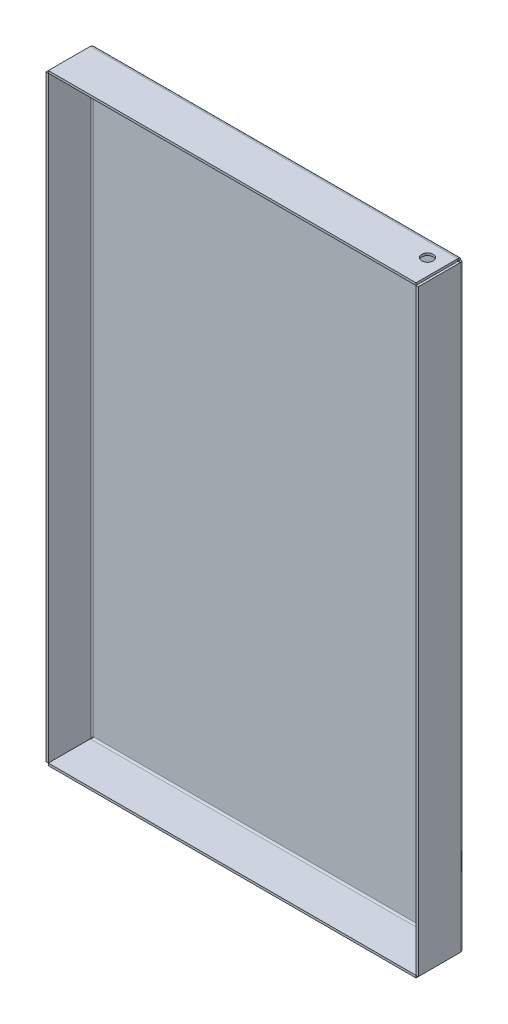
ISO-10303-21;
HEADER;
FILE_DESCRIPTION(('STEP AP214'),'2;1');
FILE_NAME('part.step','',(''),(''),'','','');
FILE_SCHEMA(('AUTOMOTIVE_DESIGN { 1 0 10303 214 1 1 1 1 }'));
ENDSEC;
DATA;
#1=APPLICATION_CONTEXT('core data for automotive mechanical design processes');
#2=APPLICATION_PROTOCOL_DEFINITION('international standard','automotive_design',2000,#1);
#3=PRODUCT_CONTEXT('',#1,'mechanical');
#4=PRODUCT('Part','Part','',(#3));
#5=PRODUCT_RELATED_PRODUCT_CATEGORY('part','',(#4));
#6=PRODUCT_DEFINITION_FORMATION('','',#4);
#7=PRODUCT_DEFINITION_CONTEXT('part definition',#1,'design');
#8=PRODUCT_DEFINITION('design','',#6,#7);
#9=PRODUCT_DEFINITION_SHAPE('','',#8);
#10=(LENGTH_UNIT() NAMED_UNIT(*) SI_UNIT(.MILLI.,.METRE.));
#11=(NAMED_UNIT(*) PLANE_ANGLE_UNIT() SI_UNIT($,.RADIAN.));
#12=(NAMED_UNIT(*) SI_UNIT($,.STERADIAN.) SOLID_ANGLE_UNIT());
#13=UNCERTAINTY_MEASURE_WITH_UNIT(LENGTH_MEASURE(1.E-05),#10,'distance_accuracy_value','');
#14=(GEOMETRIC_REPRESENTATION_CONTEXT(3) GLOBAL_UNCERTAINTY_ASSIGNED_CONTEXT((#13)) GLOBAL_UNIT_ASSIGNED_CONTEXT((#10,
#11,#12)) REPRESENTATION_CONTEXT('',''));
#15=CARTESIAN_POINT('',(0.,0.,0.));
#16=DIRECTION('',(0.,0.,1.));
#17=DIRECTION('',(1.,0.,0.));
#18=AXIS2_PLACEMENT_3D('',#15,#16,#17);
#19=CARTESIAN_POINT('',(-80.,-130.,-1.));
#20=DIRECTION('',(0.,0.,1.));
#21=DIRECTION('',(1.,0.,0.));
#22=AXIS2_PLACEMENT_3D('',#19,#20,#21);
#23=PLANE('',#22);
#24=DIRECTION('',(0.,1.,0.));
#25=VECTOR('',#24,1.);
#26=CARTESIAN_POINT('',(79.2633999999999,129.999292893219,-1.00000000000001));
#27=LINE('',#26,#25);
#28=CARTESIAN_POINT('',(79.2633999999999,129.2634,-1.00000000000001));
#29=VERTEX_POINT('',#28);
#30=CARTESIAN_POINT('',(79.2634,-129.2634,-0.999999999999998));
#31=VERTEX_POINT('',#30);
#32=EDGE_CURVE('E210',#29,#31,#27,.F.);
#33=ORIENTED_EDGE('',*,*,#32,.T.);
#34=DIRECTION('',(1.,0.,0.));
#35=VECTOR('',#34,1.);
#36=CARTESIAN_POINT('',(79.9992928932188,-129.2634,-0.999999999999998));
#37=LINE('',#36,#35);
#38=CARTESIAN_POINT('',(-79.2634,-129.2634,-1.00000000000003));
#39=VERTEX_POINT('',#38);
#40=EDGE_CURVE('E312',#31,#39,#37,.F.);
#41=ORIENTED_EDGE('',*,*,#40,.T.);
#42=DIRECTION('',(0.,-1.,0.));
#43=VECTOR('',#42,1.);
#44=CARTESIAN_POINT('',(-79.2634,-129.999292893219,-1.00000000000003));
#45=LINE('',#44,#43);
#46=CARTESIAN_POINT('',(-79.2634,129.2634,-0.999999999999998));
#47=VERTEX_POINT('',#46);
#48=EDGE_CURVE('E377',#39,#47,#45,.F.);
#49=ORIENTED_EDGE('',*,*,#48,.T.);
#50=DIRECTION('',(-1.,0.,0.));
#51=VECTOR('',#50,1.);
#52=CARTESIAN_POINT('',(-79.9992928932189,129.2634,-0.999999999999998));
#53=LINE('',#52,#51);
#54=EDGE_CURVE('E484',#47,#29,#53,.F.);
#55=ORIENTED_EDGE('',*,*,#54,.T.);
#56=EDGE_LOOP('',(#33,#41,#49,#55));
#57=FACE_BOUND('',#56,.T.);
#58=ADVANCED_FACE('F32',(#57),#23,.F.);
#59=CARTESIAN_POINT('',(-80.,-130.,0.));
#60=DIRECTION('',(0.,0.,1.));
#61=DIRECTION('',(1.,0.,0.));
#62=AXIS2_PLACEMENT_3D('',#59,#60,#61);
#63=PLANE('',#62);
#64=DIRECTION('',(1.,0.,0.));
#65=VECTOR('',#64,1.);
#66=CARTESIAN_POINT('',(79.9992928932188,-129.2634,0.));
#67=LINE('',#66,#65);
#68=CARTESIAN_POINT('',(79.2634,-129.2634,0.));
#69=VERTEX_POINT('',#68);
#70=CARTESIAN_POINT('',(-79.2634,-129.2634,0.));
#71=VERTEX_POINT('',#70);
#72=EDGE_CURVE('E49',#69,#71,#67,.F.);
#73=ORIENTED_EDGE('',*,*,#72,.F.);
#74=DIRECTION('',(0.,1.,0.));
#75=VECTOR('',#74,1.);
#76=CARTESIAN_POINT('',(79.2634,129.999292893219,0.));
#77=LINE('',#76,#75);
#78=CARTESIAN_POINT('',(79.2634,129.2634,0.));
#79=VERTEX_POINT('',#78);
#80=EDGE_CURVE('E206',#79,#69,#77,.F.);
#81=ORIENTED_EDGE('',*,*,#80,.F.);
#82=DIRECTION('',(-1.,0.,0.));
#83=VECTOR('',#82,1.);
#84=CARTESIAN_POINT('',(-79.9992928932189,129.2634,0.));
#85=LINE('',#84,#83);
#86=CARTESIAN_POINT('',(-79.2634,129.2634,0.));
#87=VERTEX_POINT('',#86);
#88=EDGE_CURVE('E508',#87,#79,#85,.F.);
#89=ORIENTED_EDGE('',*,*,#88,.F.);
#90=DIRECTION('',(0.,-1.,0.));
#91=VECTOR('',#90,1.);
#92=CARTESIAN_POINT('',(-79.2634,-129.999292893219,0.));
#93=LINE('',#92,#91);
#94=EDGE_CURVE('E54',#71,#87,#93,.F.);
#95=ORIENTED_EDGE('',*,*,#94,.F.);
#96=EDGE_LOOP('',(#73,#81,#89,#95));
#97=FACE_BOUND('',#96,.T.);
#98=ADVANCED_FACE('F34',(#97),#63,.T.);
#99=CARTESIAN_POINT('',(79.2634,129.2634,-1.01));
#100=CARTESIAN_POINT('',(79.3247347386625,129.492067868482,-1.01));
#101=CARTESIAN_POINT('',(79.3860488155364,129.720568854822,-0.96454067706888));
#102=CARTESIAN_POINT('',(79.5086976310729,130.143020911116,-0.789555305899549));
#103=CARTESIAN_POINT('',(79.5700220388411,130.336767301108,-0.66009810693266));
#104=CARTESIAN_POINT('',(79.6926708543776,130.660098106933,-0.336767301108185));
#105=CARTESIAN_POINT('',(79.7539952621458,130.7895553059,-0.143020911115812));
#106=CARTESIAN_POINT('',(79.8766440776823,130.964540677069,0.279431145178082));
#107=CARTESIAN_POINT('',(79.9379581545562,131.01,0.507932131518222));
#108=CARTESIAN_POINT('',(79.9992928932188,131.01,0.736600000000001));
#109=CARTESIAN_POINT('',(79.2634,129.2634,-0.999999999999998));
#110=CARTESIAN_POINT('',(79.3247347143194,129.49075861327,-0.999999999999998));
#111=CARTESIAN_POINT('',(79.3860488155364,129.717951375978,-0.954800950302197));
#112=CARTESIAN_POINT('',(79.5086976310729,130.137984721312,-0.780817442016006));
#113=CARTESIAN_POINT('',(79.5700220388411,130.330621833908,-0.652101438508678));
#114=CARTESIAN_POINT('',(79.6926708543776,130.652101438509,-0.330621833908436));
#115=CARTESIAN_POINT('',(79.7539952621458,130.780817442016,-0.137984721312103));
#116=CARTESIAN_POINT('',(79.8766440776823,130.954800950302,0.282048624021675));
#117=CARTESIAN_POINT('',(79.9379581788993,131.,0.509241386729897));
#118=CARTESIAN_POINT('',(79.9992928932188,131.,0.736600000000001));
#119=CARTESIAN_POINT('',(79.2634,129.2634,0.));
#120=CARTESIAN_POINT('',(79.3247322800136,129.359833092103,0.));
#121=CARTESIAN_POINT('',(79.3860488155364,129.456203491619,0.0191717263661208));
#122=CARTESIAN_POINT('',(79.5086976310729,129.634365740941,0.0929689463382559));
#123=CARTESIAN_POINT('',(79.5700220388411,129.716075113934,0.147565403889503));
#124=CARTESIAN_POINT('',(79.6926708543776,129.85243459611,0.28392488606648));
#125=CARTESIAN_POINT('',(79.7539952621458,129.907031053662,0.365634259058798));
#126=CARTESIAN_POINT('',(79.8766440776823,129.980828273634,0.543796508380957));
#127=CARTESIAN_POINT('',(79.9379606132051,130.,0.640166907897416));
#128=CARTESIAN_POINT('',(79.9992928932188,130.,0.736600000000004));
#129=CARTESIAN_POINT('',(79.2634,129.2634,0.0101000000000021));
#130=CARTESIAN_POINT('',(79.3247322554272,129.358510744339,0.0101000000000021));
#131=CARTESIAN_POINT('',(79.3860488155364,129.453559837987,0.0290088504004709));
#132=CARTESIAN_POINT('',(79.5086976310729,129.629279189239,0.101794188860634));
#133=CARTESIAN_POINT('',(79.5700220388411,129.709868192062,0.155642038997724));
#134=CARTESIAN_POINT('',(79.6926708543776,129.844357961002,0.290131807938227));
#135=CARTESIAN_POINT('',(79.7539952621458,129.898205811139,0.370720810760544));
#136=CARTESIAN_POINT('',(79.8766440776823,129.9709911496,0.546440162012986));
#137=CARTESIAN_POINT('',(79.9379606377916,129.9899,0.641489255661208));
#138=CARTESIAN_POINT('',(79.9992928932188,129.9899,0.736600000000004));
#139=B_SPLINE_SURFACE_WITH_KNOTS('',1,3,((#99,#100,#101,#102,#103,#104,#105,#106,#107,#108),
(#109,#110,#111,#112,#113,#114,#115,#116,#117,#118),(#119,#120,#121,#122,#123,#124,#125,#126,
#127,#128),(#129,#130,#131,#132,#133,#134,#135,#136,#137,#138)),.UNSPECIFIED.,.F.,.F.,.F.,(2,1,
1,2),(4,2,2,2,4),(-0.01,0.,1.,1.0101),(0.,0.25,0.5,0.75,1.),.UNSPECIFIED.);
#140=DIRECTION('',(0.,-1.,0.));
#141=VECTOR('',#140,1.);
#142=CARTESIAN_POINT('',(79.9992928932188,130.,0.736600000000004));
#143=LINE('',#142,#141);
#144=CARTESIAN_POINT('',(79.9992928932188,131.,0.736600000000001));
#145=VERTEX_POINT('',#144);
#146=CARTESIAN_POINT('',(79.9992928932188,130.,0.736600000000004));
#147=VERTEX_POINT('',#146);
#148=EDGE_CURVE('E515',#145,#147,#143,.T.);
#149=CARTESIAN_POINT('',(79.2634,129.2634,0.));
#150=CARTESIAN_POINT('',(79.2802605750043,129.289906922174,-8.00734319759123E-07));
#151=CARTESIAN_POINT('',(79.2971099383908,129.316399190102,0.00143210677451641));
#152=CARTESIAN_POINT('',(79.3308076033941,129.369075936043,0.00713809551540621));
#153=CARTESIAN_POINT('',(79.3476559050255,129.395260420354,0.0114111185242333));
#154=CARTESIAN_POINT('',(79.3981454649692,129.472802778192,0.0284203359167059));
#155=CARTESIAN_POINT('',(79.4318179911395,129.52328892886,0.0453469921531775));
#156=CARTESIAN_POINT('',(79.4967557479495,129.616041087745,0.0880253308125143));
#157=CARTESIAN_POINT('',(79.528023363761,129.658635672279,0.11307087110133));
#158=CARTESIAN_POINT('',(79.5905503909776,129.737978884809,0.171120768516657));
#159=CARTESIAN_POINT('',(79.6218097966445,129.774730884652,0.20412050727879));
#160=CARTESIAN_POINT('',(79.6843211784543,129.84093493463,0.276764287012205));
#161=CARTESIAN_POINT('',(79.7155731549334,129.870387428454,0.316407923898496));
#162=CARTESIAN_POINT('',(79.7780936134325,129.920833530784,0.400777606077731));
#163=CARTESIAN_POINT('',(79.8093620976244,129.941824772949,0.445505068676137));
#164=CARTESIAN_POINT('',(79.8670792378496,129.971974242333,0.531097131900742));
#165=CARTESIAN_POINT('',(79.8935308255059,129.982454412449,0.571500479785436));
#166=CARTESIAN_POINT('',(79.9464166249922,129.996480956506,0.653463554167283));
#167=CARTESIAN_POINT('',(79.972850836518,130.00003199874,0.695022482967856));
#168=CARTESIAN_POINT('',(79.9992928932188,130.,0.736600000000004));
#169=B_SPLINE_CURVE_WITH_KNOTS('',3,(#149,#150,#151,#152,#153,#154,#155,#156,#157,#158,#159,
#160,#161,#162,#163,#164,#165,#166,#167,#168),.UNSPECIFIED.,.F.,.F.,(4,2,2,2,2,2,2,2,2,4),(0.,
0.0941756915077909,0.188349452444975,0.376211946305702,0.550832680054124,0.725352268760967,
0.899861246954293,1.07441899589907,1.22217642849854,1.36983427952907),.UNSPECIFIED.);
#170=EDGE_CURVE('E485',#79,#147,#169,.T.);
#171=DIRECTION('',(0.,0.,-1.));
#172=VECTOR('',#171,1.);
#173=CARTESIAN_POINT('',(79.2634,129.2634,0.));
#174=LINE('',#173,#172);
#175=EDGE_CURVE('E11',#79,#29,#174,.T.);
#176=CARTESIAN_POINT('',(79.2634,129.2634,-0.999999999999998));
#177=CARTESIAN_POINT('',(79.2770550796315,129.31401352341,-0.999999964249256));
#178=CARTESIAN_POINT('',(79.2907029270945,129.364602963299,-0.9977858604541));
#179=CARTESIAN_POINT('',(79.3179973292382,129.465393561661,-0.988954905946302));
#180=CARTESIAN_POINT('',(79.3316438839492,129.51559474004,-0.982338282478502));
#181=CARTESIAN_POINT('',(79.3725577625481,129.664946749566,-0.955951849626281));
#182=CARTESIAN_POINT('',(79.3998449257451,129.76301776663,-0.929645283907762));
#183=CARTESIAN_POINT('',(79.4544236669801,129.953101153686,-0.860379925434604));
#184=CARTESIAN_POINT('',(79.4817152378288,130.04510984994,-0.817411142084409));
#185=CARTESIAN_POINT('',(79.5362926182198,130.220248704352,-0.716136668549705));
#186=CARTESIAN_POINT('',(79.5635784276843,130.303380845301,-0.657834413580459));
#187=CARTESIAN_POINT('',(79.6181516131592,130.458235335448,-0.527671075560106));
#188=CARTESIAN_POINT('',(79.6454389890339,130.529958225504,-0.455810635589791));
#189=CARTESIAN_POINT('',(79.7000196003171,130.659842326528,-0.300685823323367));
#190=CARTESIAN_POINT('',(79.7273128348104,130.717999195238,-0.217417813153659));
#191=CARTESIAN_POINT('',(79.7819084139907,130.818963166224,-0.0420220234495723));
#192=CARTESIAN_POINT('',(79.8092107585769,130.861764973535,0.050108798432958));
#193=CARTESIAN_POINT('',(79.8637998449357,130.930656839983,0.240368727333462));
#194=CARTESIAN_POINT('',(79.8910865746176,130.956763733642,0.338491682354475));
#195=CARTESIAN_POINT('',(79.9318534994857,130.982753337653,0.48736026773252));
#196=CARTESIAN_POINT('',(79.9453538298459,130.989221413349,0.537032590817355));
#197=CARTESIAN_POINT('',(79.9723313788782,130.997840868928,0.636662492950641));
#198=CARTESIAN_POINT('',(79.9858085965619,130.999999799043,0.686619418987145));
#199=CARTESIAN_POINT('',(79.9992928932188,131.,0.736600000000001));
#200=B_SPLINE_CURVE_WITH_KNOTS('',3,(#176,#177,#178,#179,#180,#181,#182,#183,#184,#185,#186,
#187,#188,#189,#190,#191,#192,#193,#194,#195,#196,#197,#198,#199),.UNSPECIFIED.,.F.,.F.,(4,2,2,
2,2,2,2,2,2,2,2,4),(0.,0.157172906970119,0.314337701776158,0.628141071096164,0.942132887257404,
1.25605441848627,1.56996106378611,1.88396804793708,2.19808320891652,2.51188112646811,
2.66736259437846,2.82257139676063),.UNSPECIFIED.);
#201=EDGE_CURVE('E471',#29,#145,#200,.T.);
#202=ORIENTED_EDGE('',*,*,#148,.T.);
#203=ORIENTED_EDGE('',*,*,#170,.F.);
#204=ORIENTED_EDGE('',*,*,#175,.T.);
#205=ORIENTED_EDGE('',*,*,#201,.T.);
#206=EDGE_LOOP('',(#202,#203,#204,#205));
#207=FACE_BOUND('',#206,.T.);
#208=ADVANCED_FACE('F466',(#207),#139,.F.);
#209=CARTESIAN_POINT('',(-79.9992928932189,131.01,0.736599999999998));
#210=CARTESIAN_POINT('',(-79.9379581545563,131.01,0.507932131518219));
#211=CARTESIAN_POINT('',(-79.8766440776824,130.964540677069,0.27943114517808));
#212=CARTESIAN_POINT('',(-79.7539952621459,130.7895553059,-0.143020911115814));
#213=CARTESIAN_POINT('',(-79.6926708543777,130.660098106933,-0.336767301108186));
#214=CARTESIAN_POINT('',(-79.5700220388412,130.336767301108,-0.660098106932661));
#215=CARTESIAN_POINT('',(-79.508697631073,130.143020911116,-0.789555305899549));
#216=CARTESIAN_POINT('',(-79.3860488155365,129.720568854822,-0.96454067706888));
#217=CARTESIAN_POINT('',(-79.3247347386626,129.492067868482,-1.01));
#218=CARTESIAN_POINT('',(-79.2634,129.2634,-1.01));
#219=CARTESIAN_POINT('',(-79.9992928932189,131.,0.736599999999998));
#220=CARTESIAN_POINT('',(-79.9379581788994,131.,0.509241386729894));
#221=CARTESIAN_POINT('',(-79.8766440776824,130.954800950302,0.282048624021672));
#222=CARTESIAN_POINT('',(-79.7539952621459,130.780817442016,-0.137984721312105));
#223=CARTESIAN_POINT('',(-79.6926708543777,130.652101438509,-0.330621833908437));
#224=CARTESIAN_POINT('',(-79.5700220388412,130.330621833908,-0.652101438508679));
#225=CARTESIAN_POINT('',(-79.508697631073,130.137984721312,-0.780817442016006));
#226=CARTESIAN_POINT('',(-79.3860488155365,129.717951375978,-0.954800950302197));
#227=CARTESIAN_POINT('',(-79.3247347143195,129.49075861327,-0.999999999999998));
#228=CARTESIAN_POINT('',(-79.2634,129.2634,-0.999999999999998));
#229=CARTESIAN_POINT('',(-79.9992928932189,130.,0.736600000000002));
#230=CARTESIAN_POINT('',(-79.9379606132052,130.,0.640166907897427));
#231=CARTESIAN_POINT('',(-79.8766440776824,129.980828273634,0.543796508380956));
#232=CARTESIAN_POINT('',(-79.7539952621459,129.907031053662,0.365634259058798));
#233=CARTESIAN_POINT('',(-79.6926708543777,129.85243459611,0.28392488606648));
#234=CARTESIAN_POINT('',(-79.5700220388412,129.716075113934,0.147565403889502));
#235=CARTESIAN_POINT('',(-79.508697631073,129.634365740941,0.0929689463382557));
#236=CARTESIAN_POINT('',(-79.3860488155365,129.456203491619,0.0191717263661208));
#237=CARTESIAN_POINT('',(-79.3247322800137,129.359833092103,0.));
#238=CARTESIAN_POINT('',(-79.2634,129.2634,0.));
#239=CARTESIAN_POINT('',(-79.9992928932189,129.9899,0.736600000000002));
#240=CARTESIAN_POINT('',(-79.9379606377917,129.9899,0.641489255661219));
#241=CARTESIAN_POINT('',(-79.8766440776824,129.9709911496,0.546440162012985));
#242=CARTESIAN_POINT('',(-79.7539952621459,129.898205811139,0.370720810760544));
#243=CARTESIAN_POINT('',(-79.6926708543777,129.844357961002,0.290131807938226));
#244=CARTESIAN_POINT('',(-79.5700220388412,129.709868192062,0.155642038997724));
#245=CARTESIAN_POINT('',(-79.508697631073,129.629279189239,0.101794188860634));
#246=CARTESIAN_POINT('',(-79.3860488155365,129.453559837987,0.0290088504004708));
#247=CARTESIAN_POINT('',(-79.3247322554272,129.358510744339,0.0101000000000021));
#248=CARTESIAN_POINT('',(-79.2634,129.2634,0.0101000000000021));
#249=B_SPLINE_SURFACE_WITH_KNOTS('',1,3,((#209,#210,#211,#212,#213,#214,#215,#216,#217,#218),
(#219,#220,#221,#222,#223,#224,#225,#226,#227,#228),(#229,#230,#231,#232,#233,#234,#235,#236,
#237,#238),(#239,#240,#241,#242,#243,#244,#245,#246,#247,#248)),.UNSPECIFIED.,.F.,.F.,.F.,(2,1,
1,2),(4,2,2,2,4),(-0.01,0.,1.,1.0101),(0.,0.25,0.5,0.75,1.),.UNSPECIFIED.);
#250=CARTESIAN_POINT('',(-79.9992928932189,130.,0.736600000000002));
#251=CARTESIAN_POINT('',(-79.9824323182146,130.000000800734,0.710093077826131));
#252=CARTESIAN_POINT('',(-79.9655829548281,129.998567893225,0.683600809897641));
#253=CARTESIAN_POINT('',(-79.9318852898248,129.992861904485,0.630924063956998));
#254=CARTESIAN_POINT('',(-79.9150369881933,129.988588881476,0.604739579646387));
#255=CARTESIAN_POINT('',(-79.8645474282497,129.971579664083,0.527197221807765));
#256=CARTESIAN_POINT('',(-79.8308749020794,129.954653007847,0.476711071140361));
#257=CARTESIAN_POINT('',(-79.7659371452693,129.911974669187,0.383958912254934));
#258=CARTESIAN_POINT('',(-79.7346695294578,129.886929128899,0.341364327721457));
#259=CARTESIAN_POINT('',(-79.6721425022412,129.828879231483,0.262021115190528));
#260=CARTESIAN_POINT('',(-79.6408830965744,129.795879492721,0.225269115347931));
#261=CARTESIAN_POINT('',(-79.5783717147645,129.723235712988,0.159065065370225));
#262=CARTESIAN_POINT('',(-79.5471197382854,129.683592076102,0.129612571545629));
#263=CARTESIAN_POINT('',(-79.4845992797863,129.599222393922,0.0791664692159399));
#264=CARTESIAN_POINT('',(-79.4533307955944,129.554494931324,0.0581752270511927));
#265=CARTESIAN_POINT('',(-79.3956136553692,129.468902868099,0.0280257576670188));
#266=CARTESIAN_POINT('',(-79.3691620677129,129.428499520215,0.0175455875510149));
#267=CARTESIAN_POINT('',(-79.3162762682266,129.346536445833,0.00351904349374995));
#268=CARTESIAN_POINT('',(-79.2898420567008,129.304977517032,-3.1998740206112E-05));
#269=CARTESIAN_POINT('',(-79.2634,129.2634,0.));
#270=B_SPLINE_CURVE_WITH_KNOTS('',3,(#250,#251,#252,#253,#254,#255,#256,#257,#258,#259,#260,
#261,#262,#263,#264,#265,#266,#267,#268,#269),.UNSPECIFIED.,.F.,.F.,(4,2,2,2,2,2,2,2,2,4),(0.,
0.0941756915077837,0.188349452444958,0.376211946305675,0.550832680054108,0.725352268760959,
0.89986124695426,1.07441899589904,1.22217642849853,1.36983427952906),.UNSPECIFIED.);
#271=CARTESIAN_POINT('',(-79.9992928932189,130.,0.736600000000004));
#272=VERTEX_POINT('',#271);
#273=EDGE_CURVE('E503',#272,#87,#270,.T.);
#274=DIRECTION('',(0.,-1.,0.));
#275=VECTOR('',#274,1.);
#276=CARTESIAN_POINT('',(-79.9992928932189,130.,0.736600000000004));
#277=LINE('',#276,#275);
#278=CARTESIAN_POINT('',(-79.9992928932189,131.,0.736600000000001));
#279=VERTEX_POINT('',#278);
#280=EDGE_CURVE('E509',#279,#272,#277,.T.);
#281=CARTESIAN_POINT('',(-79.9992928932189,131.,0.736599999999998));
#282=CARTESIAN_POINT('',(-79.9856378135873,130.999999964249,0.685986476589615));
#283=CARTESIAN_POINT('',(-79.9719899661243,130.997785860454,0.63539703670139));
#284=CARTESIAN_POINT('',(-79.9446955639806,130.988954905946,0.534606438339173));
#285=CARTESIAN_POINT('',(-79.9310490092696,130.982338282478,0.48440525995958));
#286=CARTESIAN_POINT('',(-79.8901351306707,130.955951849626,0.335053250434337));
#287=CARTESIAN_POINT('',(-79.8628479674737,130.929645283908,0.236982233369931));
#288=CARTESIAN_POINT('',(-79.8082692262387,130.860379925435,0.0468988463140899));
#289=CARTESIAN_POINT('',(-79.78097765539,130.817411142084,-0.045109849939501));
#290=CARTESIAN_POINT('',(-79.7264002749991,130.71613666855,-0.220248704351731));
#291=CARTESIAN_POINT('',(-79.6991144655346,130.657834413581,-0.303380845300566));
#292=CARTESIAN_POINT('',(-79.6445412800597,130.52767107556,-0.458235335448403));
#293=CARTESIAN_POINT('',(-79.6172539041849,130.45581063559,-0.529958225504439));
#294=CARTESIAN_POINT('',(-79.5626732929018,130.300685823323,-0.659842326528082));
#295=CARTESIAN_POINT('',(-79.5353800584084,130.217417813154,-0.717999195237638));
#296=CARTESIAN_POINT('',(-79.4807844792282,130.04202202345,-0.818963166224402));
#297=CARTESIAN_POINT('',(-79.4534821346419,129.949891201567,-0.861764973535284));
#298=CARTESIAN_POINT('',(-79.3988930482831,129.759631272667,-0.93065683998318));
#299=CARTESIAN_POINT('',(-79.3716063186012,129.661508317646,-0.956763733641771));
#300=CARTESIAN_POINT('',(-79.3308393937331,129.512639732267,-0.982753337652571));
#301=CARTESIAN_POINT('',(-79.317339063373,129.462967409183,-0.989221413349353));
#302=CARTESIAN_POINT('',(-79.2903615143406,129.363337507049,-0.997840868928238));
#303=CARTESIAN_POINT('',(-79.2768842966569,129.313380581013,-0.999999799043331));
#304=CARTESIAN_POINT('',(-79.2634,129.2634,-0.999999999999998));
#305=B_SPLINE_CURVE_WITH_KNOTS('',3,(#281,#282,#283,#284,#285,#286,#287,#288,#289,#290,#291,
#292,#293,#294,#295,#296,#297,#298,#299,#300,#301,#302,#303,#304),.UNSPECIFIED.,.F.,.F.,(4,2,2,
2,2,2,2,2,2,2,2,4),(0.,0.157172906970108,0.314337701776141,0.628141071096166,0.942132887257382,
1.25605441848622,1.56996106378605,1.88396804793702,2.19808320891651,2.5118811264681,
2.66736259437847,2.82257139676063),.UNSPECIFIED.);
#306=EDGE_CURVE('E477',#279,#47,#305,.T.);
#307=DIRECTION('',(0.,0.,-1.));
#308=VECTOR('',#307,1.);
#309=CARTESIAN_POINT('',(-79.2634,129.2634,0.));
#310=LINE('',#309,#308);
#311=EDGE_CURVE('E41',#87,#47,#310,.T.);
#312=ORIENTED_EDGE('',*,*,#273,.F.);
#313=ORIENTED_EDGE('',*,*,#280,.F.);
#314=ORIENTED_EDGE('',*,*,#306,.T.);
#315=ORIENTED_EDGE('',*,*,#311,.F.);
#316=EDGE_LOOP('',(#312,#313,#314,#315));
#317=FACE_BOUND('',#316,.T.);
#318=ADVANCED_FACE('F464',(#317),#249,.F.);
#319=CARTESIAN_POINT('',(-79.9992928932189,129.2634,0.736600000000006));
#320=DIRECTION('',(-1.,0.,0.));
#321=DIRECTION('',(0.,1.,0.));
#322=AXIS2_PLACEMENT_3D('',#319,#320,#321);
#323=CYLINDRICAL_SURFACE('',#322,1.7366);
#324=ORIENTED_EDGE('',*,*,#54,.F.);
#325=ORIENTED_EDGE('',*,*,#306,.F.);
#326=DIRECTION('',(-1.,0.,0.));
#327=VECTOR('',#326,1.);
#328=CARTESIAN_POINT('',(-80.,131.,0.736600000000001));
#329=LINE('',#328,#327);
#330=EDGE_CURVE('E547',#145,#279,#329,.T.);
#331=ORIENTED_EDGE('',*,*,#330,.F.);
#332=ORIENTED_EDGE('',*,*,#201,.F.);
#333=EDGE_LOOP('',(#324,#325,#331,#332));
#334=FACE_BOUND('',#333,.T.);
#335=ADVANCED_FACE('F460',(#334),#323,.T.);
#336=CARTESIAN_POINT('',(-79.9992928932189,129.2634,0.736600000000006));
#337=DIRECTION('',(-1.,0.,0.));
#338=DIRECTION('',(0.,1.,0.));
#339=AXIS2_PLACEMENT_3D('',#336,#337,#338);
#340=CYLINDRICAL_SURFACE('',#339,0.736600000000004);
#341=ORIENTED_EDGE('',*,*,#88,.T.);
#342=ORIENTED_EDGE('',*,*,#170,.T.);
#343=DIRECTION('',(-1.,0.,0.));
#344=VECTOR('',#343,1.);
#345=CARTESIAN_POINT('',(80.,130.,0.736600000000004));
#346=LINE('',#345,#344);
#347=EDGE_CURVE('E551',#147,#272,#346,.T.);
#348=ORIENTED_EDGE('',*,*,#347,.T.);
#349=ORIENTED_EDGE('',*,*,#273,.T.);
#350=EDGE_LOOP('',(#341,#342,#348,#349));
#351=FACE_BOUND('',#350,.T.);
#352=ADVANCED_FACE('F448',(#351),#340,.F.);
#353=CARTESIAN_POINT('',(79.9992928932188,130.,0.));
#354=DIRECTION('',(1.,0.,0.));
#355=DIRECTION('',(0.,0.,-1.));
#356=AXIS2_PLACEMENT_3D('',#353,#354,#355);
#357=PLANE('',#356);
#358=DIRECTION('',(0.,1.,0.));
#359=VECTOR('',#358,1.);
#360=CARTESIAN_POINT('',(79.9992928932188,131.,19.));
#361=LINE('',#360,#359);
#362=CARTESIAN_POINT('',(79.9992928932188,130.,19.));
#363=VERTEX_POINT('',#362);
#364=CARTESIAN_POINT('',(79.9992928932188,131.,19.));
#365=VERTEX_POINT('',#364);
#366=EDGE_CURVE('E549',#363,#365,#361,.T.);
#367=ORIENTED_EDGE('',*,*,#366,.F.);
#368=DIRECTION('',(0.,0.,1.));
#369=VECTOR('',#368,1.);
#370=CARTESIAN_POINT('',(79.9992928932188,130.,0.));
#371=LINE('',#370,#369);
#372=EDGE_CURVE('E542',#147,#363,#371,.T.);
#373=ORIENTED_EDGE('',*,*,#372,.F.);
#374=ORIENTED_EDGE('',*,*,#148,.F.);
#375=DIRECTION('',(0.,0.,-1.));
#376=VECTOR('',#375,1.);
#377=CARTESIAN_POINT('',(79.9992928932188,131.,0.));
#378=LINE('',#377,#376);
#379=EDGE_CURVE('E539',#365,#145,#378,.T.);
#380=ORIENTED_EDGE('',*,*,#379,.F.);
#381=EDGE_LOOP('',(#367,#373,#374,#380));
#382=FACE_BOUND('',#381,.T.);
#383=ADVANCED_FACE('F444',(#382),#357,.T.);
#384=CARTESIAN_POINT('',(-80.,131.,0.));
#385=DIRECTION('',(0.,1.,0.));
#386=DIRECTION('',(0.,0.,1.));
#387=AXIS2_PLACEMENT_3D('',#384,#385,#386);
#388=PLANE('',#387);
#389=CARTESIAN_POINT('',(73.,131.,7.00000000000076));
#390=DIRECTION('',(0.,1.,0.));
#391=DIRECTION('',(0.,0.,1.));
#392=AXIS2_PLACEMENT_3D('',#389,#390,#391);
#393=CIRCLE('',#392,2.5);
#394=CARTESIAN_POINT('',(73.,131.,9.50000000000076));
#395=VERTEX_POINT('',#394);
#396=EDGE_CURVE('E596',#395,#395,#393,.T.);
#397=ORIENTED_EDGE('',*,*,#396,.F.);
#398=EDGE_LOOP('',(#397));
#399=FACE_BOUND('',#398,.T.);
#400=DIRECTION('',(0.,0.,-1.));
#401=VECTOR('',#400,1.);
#402=CARTESIAN_POINT('',(-79.9992928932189,131.,0.));
#403=LINE('',#402,#401);
#404=CARTESIAN_POINT('',(-79.9992928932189,131.,19.));
#405=VERTEX_POINT('',#404);
#406=EDGE_CURVE('E565',#405,#279,#403,.T.);
#407=ORIENTED_EDGE('',*,*,#406,.F.);
#408=DIRECTION('',(-1.,0.,0.));
#409=VECTOR('',#408,1.);
#410=CARTESIAN_POINT('',(-80.,131.,19.));
#411=LINE('',#410,#409);
#412=EDGE_CURVE('E520',#365,#405,#411,.T.);
#413=ORIENTED_EDGE('',*,*,#412,.F.);
#414=ORIENTED_EDGE('',*,*,#379,.T.);
#415=ORIENTED_EDGE('',*,*,#330,.T.);
#416=EDGE_LOOP('',(#407,#413,#414,#415));
#417=FACE_BOUND('',#416,.T.);
#418=ADVANCED_FACE('F447',(#399,#417),#388,.T.);
#419=CARTESIAN_POINT('',(-80.,130.,0.));
#420=DIRECTION('',(0.,1.,0.));
#421=DIRECTION('',(0.,0.,1.));
#422=AXIS2_PLACEMENT_3D('',#419,#420,#421);
#423=PLANE('',#422);
#424=CARTESIAN_POINT('',(73.,130.,7.00000000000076));
#425=DIRECTION('',(0.,1.,0.));
#426=DIRECTION('',(0.,0.,1.));
#427=AXIS2_PLACEMENT_3D('',#424,#425,#426);
#428=CIRCLE('',#427,2.5);
#429=CARTESIAN_POINT('',(73.,130.,9.50000000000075));
#430=VERTEX_POINT('',#429);
#431=EDGE_CURVE('E590',#430,#430,#428,.T.);
#432=ORIENTED_EDGE('',*,*,#431,.T.);
#433=EDGE_LOOP('',(#432));
#434=FACE_BOUND('',#433,.T.);
#435=DIRECTION('',(-1.,0.,0.));
#436=VECTOR('',#435,1.);
#437=CARTESIAN_POINT('',(-80.,130.,19.));
#438=LINE('',#437,#436);
#439=CARTESIAN_POINT('',(-79.9992928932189,130.,19.));
#440=VERTEX_POINT('',#439);
#441=EDGE_CURVE('E559',#363,#440,#438,.T.);
#442=ORIENTED_EDGE('',*,*,#441,.T.);
#443=DIRECTION('',(0.,0.,1.));
#444=VECTOR('',#443,1.);
#445=CARTESIAN_POINT('',(-79.9992928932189,130.,0.));
#446=LINE('',#445,#444);
#447=EDGE_CURVE('E384',#272,#440,#446,.T.);
#448=ORIENTED_EDGE('',*,*,#447,.F.);
#449=ORIENTED_EDGE('',*,*,#347,.F.);
#450=ORIENTED_EDGE('',*,*,#372,.T.);
#451=EDGE_LOOP('',(#442,#448,#449,#450));
#452=FACE_BOUND('',#451,.T.);
#453=ADVANCED_FACE('F452',(#434,#452),#423,.F.);
#454=CARTESIAN_POINT('',(-80.,131.,19.));
#455=DIRECTION('',(0.,0.,1.));
#456=DIRECTION('',(0.,-1.,0.));
#457=AXIS2_PLACEMENT_3D('',#454,#455,#456);
#458=PLANE('',#457);
#459=DIRECTION('',(0.,1.,0.));
#460=VECTOR('',#459,1.);
#461=CARTESIAN_POINT('',(-79.9992928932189,131.,19.));
#462=LINE('',#461,#460);
#463=EDGE_CURVE('E553',#440,#405,#462,.T.);
#464=ORIENTED_EDGE('',*,*,#463,.F.);
#465=ORIENTED_EDGE('',*,*,#441,.F.);
#466=ORIENTED_EDGE('',*,*,#366,.T.);
#467=ORIENTED_EDGE('',*,*,#412,.T.);
#468=EDGE_LOOP('',(#464,#465,#466,#467));
#469=FACE_BOUND('',#468,.T.);
#470=ADVANCED_FACE('F442',(#469),#458,.T.);
#471=CARTESIAN_POINT('',(-79.9992928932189,130.,0.));
#472=DIRECTION('',(1.,0.,0.));
#473=DIRECTION('',(0.,0.,-1.));
#474=AXIS2_PLACEMENT_3D('',#471,#472,#473);
#475=PLANE('',#474);
#476=ORIENTED_EDGE('',*,*,#447,.T.);
#477=ORIENTED_EDGE('',*,*,#463,.T.);
#478=ORIENTED_EDGE('',*,*,#406,.T.);
#479=ORIENTED_EDGE('',*,*,#280,.T.);
#480=EDGE_LOOP('',(#476,#477,#478,#479));
#481=FACE_BOUND('',#480,.T.);
#482=ADVANCED_FACE('F433',(#481),#475,.F.);
#483=CARTESIAN_POINT('',(-79.2634,129.2634,-1.01000000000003));
#484=CARTESIAN_POINT('',(-79.4920678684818,129.324734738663,-1.01000000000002));
#485=CARTESIAN_POINT('',(-79.720568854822,129.386048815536,-0.964540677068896));
#486=CARTESIAN_POINT('',(-80.1430209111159,129.508697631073,-0.789555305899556));
#487=CARTESIAN_POINT('',(-80.3367673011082,129.570022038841,-0.660098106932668));
#488=CARTESIAN_POINT('',(-80.6600981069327,129.692670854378,-0.336767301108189));
#489=CARTESIAN_POINT('',(-80.7895553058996,129.753995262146,-0.143020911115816));
#490=CARTESIAN_POINT('',(-80.9645406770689,129.876644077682,0.27943114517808));
#491=CARTESIAN_POINT('',(-81.01,129.937958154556,0.507932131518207));
#492=CARTESIAN_POINT('',(-81.01,129.999292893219,0.7366));
#493=CARTESIAN_POINT('',(-79.2634,129.2634,-1.00000000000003));
#494=CARTESIAN_POINT('',(-79.4907586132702,129.324734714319,-1.00000000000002));
#495=CARTESIAN_POINT('',(-79.7179513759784,129.386048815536,-0.954800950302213));
#496=CARTESIAN_POINT('',(-80.1379847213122,129.508697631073,-0.780817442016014));
#497=CARTESIAN_POINT('',(-80.3306218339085,129.570022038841,-0.652101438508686));
#498=CARTESIAN_POINT('',(-80.6521014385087,129.692670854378,-0.33062183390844));
#499=CARTESIAN_POINT('',(-80.7808174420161,129.753995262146,-0.137984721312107));
#500=CARTESIAN_POINT('',(-80.9548009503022,129.876644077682,0.282048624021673));
#501=CARTESIAN_POINT('',(-81.,129.937958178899,0.509241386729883));
#502=CARTESIAN_POINT('',(-81.,129.999292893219,0.7366));
#503=CARTESIAN_POINT('',(-79.2634,129.2634,0.));
#504=CARTESIAN_POINT('',(-79.3598330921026,129.324732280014,0.));
#505=CARTESIAN_POINT('',(-79.4562034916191,129.386048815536,0.0191717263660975));
#506=CARTESIAN_POINT('',(-79.6343657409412,129.508697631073,0.0929689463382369));
#507=CARTESIAN_POINT('',(-79.7160751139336,129.570022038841,0.147565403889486));
#508=CARTESIAN_POINT('',(-79.8524345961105,129.692670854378,0.283924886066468));
#509=CARTESIAN_POINT('',(-79.9070310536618,129.753995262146,0.365634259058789));
#510=CARTESIAN_POINT('',(-79.9808282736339,129.876644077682,0.543796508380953));
#511=CARTESIAN_POINT('',(-80.,129.937960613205,0.640166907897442));
#512=CARTESIAN_POINT('',(-80.,129.999292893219,0.736600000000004));
#513=CARTESIAN_POINT('',(-79.2634,129.2634,0.010099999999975));
#514=CARTESIAN_POINT('',(-79.3585107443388,129.324732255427,0.0100999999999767));
#515=CARTESIAN_POINT('',(-79.453559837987,129.386048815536,0.0290088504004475));
#516=CARTESIAN_POINT('',(-79.6292791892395,129.508697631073,0.101794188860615));
#517=CARTESIAN_POINT('',(-79.7098681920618,129.570022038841,0.155642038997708));
#518=CARTESIAN_POINT('',(-79.8443579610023,129.692670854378,0.290131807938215));
#519=CARTESIAN_POINT('',(-79.8982058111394,129.753995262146,0.370720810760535));
#520=CARTESIAN_POINT('',(-79.9709911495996,129.876644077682,0.546440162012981));
#521=CARTESIAN_POINT('',(-79.9899,129.937960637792,0.641489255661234));
#522=CARTESIAN_POINT('',(-79.9899,129.999292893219,0.736600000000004));
#523=B_SPLINE_SURFACE_WITH_KNOTS('',1,3,((#483,#484,#485,#486,#487,#488,#489,#490,#491,#492),
(#493,#494,#495,#496,#497,#498,#499,#500,#501,#502),(#503,#504,#505,#506,#507,#508,#509,#510,
#511,#512),(#513,#514,#515,#516,#517,#518,#519,#520,#521,#522)),.UNSPECIFIED.,.F.,.F.,.F.,(2,1,
1,2),(4,2,2,2,4),(-0.01,0.,1.,1.0101),(0.,0.25,0.5,0.75,1.),.UNSPECIFIED.);
#524=DIRECTION('',(1.,0.,0.));
#525=VECTOR('',#524,1.);
#526=CARTESIAN_POINT('',(-80.,129.999292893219,0.736600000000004));
#527=LINE('',#526,#525);
#528=CARTESIAN_POINT('',(-81.,129.999292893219,0.7366));
#529=VERTEX_POINT('',#528);
#530=CARTESIAN_POINT('',(-80.,129.999292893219,0.736600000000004));
#531=VERTEX_POINT('',#530);
#532=EDGE_CURVE('E367',#529,#531,#527,.T.);
#533=CARTESIAN_POINT('',(-79.2634,129.2634,0.));
#534=CARTESIAN_POINT('',(-79.2899069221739,129.280260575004,-8.00734343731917E-07));
#535=CARTESIAN_POINT('',(-79.3163991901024,129.297109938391,0.00143210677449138));
#536=CARTESIAN_POINT('',(-79.369075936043,129.330807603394,0.00713809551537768));
#537=CARTESIAN_POINT('',(-79.3952604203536,129.347655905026,0.0114111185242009));
#538=CARTESIAN_POINT('',(-79.4728027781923,129.398145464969,0.0284203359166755));
#539=CARTESIAN_POINT('',(-79.5232889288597,129.431817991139,0.0453469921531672));
#540=CARTESIAN_POINT('',(-79.6160410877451,129.49675574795,0.0880253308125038));
#541=CARTESIAN_POINT('',(-79.6586356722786,129.528023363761,0.113070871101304));
#542=CARTESIAN_POINT('',(-79.7379788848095,129.590550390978,0.171120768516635));
#543=CARTESIAN_POINT('',(-79.7747308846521,129.621809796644,0.204120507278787));
#544=CARTESIAN_POINT('',(-79.8409349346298,129.684321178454,0.276764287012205));
#545=CARTESIAN_POINT('',(-79.8703874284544,129.715573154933,0.316407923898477));
#546=CARTESIAN_POINT('',(-79.9208335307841,129.778093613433,0.400777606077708));
#547=CARTESIAN_POINT('',(-79.9418247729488,129.809362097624,0.44550506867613));
#548=CARTESIAN_POINT('',(-79.971974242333,129.86707923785,0.531097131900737));
#549=CARTESIAN_POINT('',(-79.982454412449,129.893530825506,0.571500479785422));
#550=CARTESIAN_POINT('',(-79.9964809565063,129.946416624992,0.65346355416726));
#551=CARTESIAN_POINT('',(-80.0000319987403,129.972850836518,0.695022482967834));
#552=CARTESIAN_POINT('',(-80.,129.999292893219,0.736600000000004));
#553=B_SPLINE_CURVE_WITH_KNOTS('',3,(#533,#534,#535,#536,#537,#538,#539,#540,#541,#542,#543,
#544,#545,#546,#547,#548,#549,#550,#551,#552),.UNSPECIFIED.,.F.,.F.,(4,2,2,2,2,2,2,2,2,4),(0.,
0.0941756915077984,0.18834945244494,0.376211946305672,0.550832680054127,0.725352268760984,
0.899861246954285,1.07441899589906,1.22217642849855,1.36983427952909),.UNSPECIFIED.);
#554=EDGE_CURVE('E376',#87,#531,#553,.T.);
#555=CARTESIAN_POINT('',(-79.2634,129.2634,-1.00000000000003));
#556=CARTESIAN_POINT('',(-79.3140135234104,129.277055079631,-0.999999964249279));
#557=CARTESIAN_POINT('',(-79.3646029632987,129.290702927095,-0.997785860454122));
#558=CARTESIAN_POINT('',(-79.4653935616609,129.317997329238,-0.988954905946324));
#559=CARTESIAN_POINT('',(-79.5155947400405,129.331643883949,-0.982338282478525));
#560=CARTESIAN_POINT('',(-79.6649467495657,129.372557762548,-0.955951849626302));
#561=CARTESIAN_POINT('',(-79.7630177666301,129.399844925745,-0.929645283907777));
#562=CARTESIAN_POINT('',(-79.953101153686,129.45442366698,-0.860379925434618));
#563=CARTESIAN_POINT('',(-80.0451098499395,129.481715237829,-0.817411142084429));
#564=CARTESIAN_POINT('',(-80.2202487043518,129.53629261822,-0.716136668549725));
#565=CARTESIAN_POINT('',(-80.3033808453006,129.563578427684,-0.65783441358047));
#566=CARTESIAN_POINT('',(-80.4582353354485,129.618151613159,-0.527671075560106));
#567=CARTESIAN_POINT('',(-80.5299582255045,129.645438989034,-0.45581063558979));
#568=CARTESIAN_POINT('',(-80.6598423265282,129.700019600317,-0.300685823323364));
#569=CARTESIAN_POINT('',(-80.7179991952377,129.72731283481,-0.217417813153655));
#570=CARTESIAN_POINT('',(-80.8189631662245,129.781908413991,-0.0420220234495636));
#571=CARTESIAN_POINT('',(-80.8617649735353,129.809210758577,0.0501087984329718));
#572=CARTESIAN_POINT('',(-80.9306568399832,129.863799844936,0.240368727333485));
#573=CARTESIAN_POINT('',(-80.9567637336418,129.891086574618,0.338491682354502));
#574=CARTESIAN_POINT('',(-80.9827533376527,129.931853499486,0.487360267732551));
#575=CARTESIAN_POINT('',(-80.9892214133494,129.945353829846,0.537032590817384));
#576=CARTESIAN_POINT('',(-80.9978408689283,129.972331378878,0.63666249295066));
#577=CARTESIAN_POINT('',(-80.9999997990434,129.985808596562,0.686619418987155));
#578=CARTESIAN_POINT('',(-81.,129.999292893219,0.7366));
#579=B_SPLINE_CURVE_WITH_KNOTS('',3,(#555,#556,#557,#558,#559,#560,#561,#562,#563,#564,#565,
#566,#567,#568,#569,#570,#571,#572,#573,#574,#575,#576,#577,#578),.UNSPECIFIED.,.F.,.F.,(4,2,2,
2,2,2,2,2,2,2,2,4),(0.,0.157172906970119,0.314337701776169,0.628141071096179,0.942132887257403,
1.25605441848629,1.56996106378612,1.8839680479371,2.19808320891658,2.51188112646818,
2.66736259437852,2.82257139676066),.UNSPECIFIED.);
#580=EDGE_CURVE('E379',#47,#529,#579,.T.);
#581=ORIENTED_EDGE('',*,*,#532,.T.);
#582=ORIENTED_EDGE('',*,*,#554,.F.);
#583=ORIENTED_EDGE('',*,*,#311,.T.);
#584=ORIENTED_EDGE('',*,*,#580,.T.);
#585=EDGE_LOOP('',(#581,#582,#583,#584));
#586=FACE_BOUND('',#585,.T.);
#587=ADVANCED_FACE('F397',(#586),#523,.F.);
#588=CARTESIAN_POINT('',(-81.01,-129.999292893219,0.736599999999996));
#589=CARTESIAN_POINT('',(-81.01,-129.937958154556,0.507932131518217));
#590=CARTESIAN_POINT('',(-80.9645406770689,-129.876644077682,0.279431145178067));
#591=CARTESIAN_POINT('',(-80.7895553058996,-129.753995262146,-0.143020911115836));
#592=CARTESIAN_POINT('',(-80.6600981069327,-129.692670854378,-0.336767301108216));
#593=CARTESIAN_POINT('',(-80.3367673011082,-129.570022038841,-0.660098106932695));
#594=CARTESIAN_POINT('',(-80.1430209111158,-129.508697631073,-0.789555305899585));
#595=CARTESIAN_POINT('',(-79.7205688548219,-129.386048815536,-0.964540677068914));
#596=CARTESIAN_POINT('',(-79.4920678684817,-129.324734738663,-1.01000000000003));
#597=CARTESIAN_POINT('',(-79.2634,-129.2634,-1.01000000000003));
#598=CARTESIAN_POINT('',(-81.,-129.999292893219,0.736599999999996));
#599=CARTESIAN_POINT('',(-81.,-129.937958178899,0.509241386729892));
#600=CARTESIAN_POINT('',(-80.9548009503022,-129.876644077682,0.28204862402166));
#601=CARTESIAN_POINT('',(-80.780817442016,-129.753995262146,-0.137984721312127));
#602=CARTESIAN_POINT('',(-80.6521014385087,-129.692670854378,-0.330621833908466));
#603=CARTESIAN_POINT('',(-80.3306218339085,-129.570022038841,-0.652101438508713));
#604=CARTESIAN_POINT('',(-80.1379847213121,-129.508697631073,-0.780817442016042));
#605=CARTESIAN_POINT('',(-79.7179513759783,-129.386048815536,-0.954800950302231));
#606=CARTESIAN_POINT('',(-79.4907586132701,-129.324734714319,-1.00000000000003));
#607=CARTESIAN_POINT('',(-79.2634,-129.2634,-1.00000000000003));
#608=CARTESIAN_POINT('',(-80.,-129.999292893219,0.736600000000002));
#609=CARTESIAN_POINT('',(-80.,-129.937960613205,0.640166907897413));
#610=CARTESIAN_POINT('',(-79.9808282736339,-129.876644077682,0.543796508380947));
#611=CARTESIAN_POINT('',(-79.9070310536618,-129.753995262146,0.365634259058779));
#612=CARTESIAN_POINT('',(-79.8524345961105,-129.692670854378,0.283924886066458));
#613=CARTESIAN_POINT('',(-79.7160751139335,-129.570022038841,0.147565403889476));
#614=CARTESIAN_POINT('',(-79.6343657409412,-129.508697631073,0.092968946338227));
#615=CARTESIAN_POINT('',(-79.456203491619,-129.386048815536,0.0191717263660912));
#616=CARTESIAN_POINT('',(-79.3598330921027,-129.324732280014,0.));
#617=CARTESIAN_POINT('',(-79.2634,-129.2634,0.));
#618=CARTESIAN_POINT('',(-79.9899,-129.999292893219,0.736600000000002));
#619=CARTESIAN_POINT('',(-79.9899,-129.937960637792,0.641489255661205));
#620=CARTESIAN_POINT('',(-79.9709911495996,-129.876644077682,0.546440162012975));
#621=CARTESIAN_POINT('',(-79.8982058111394,-129.753995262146,0.370720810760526));
#622=CARTESIAN_POINT('',(-79.8443579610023,-129.692670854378,0.290131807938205));
#623=CARTESIAN_POINT('',(-79.7098681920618,-129.570022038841,0.155642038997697));
#624=CARTESIAN_POINT('',(-79.6292791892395,-129.508697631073,0.101794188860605));
#625=CARTESIAN_POINT('',(-79.453559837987,-129.386048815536,0.0290088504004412));
#626=CARTESIAN_POINT('',(-79.3585107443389,-129.324732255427,0.0100999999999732));
#627=CARTESIAN_POINT('',(-79.2634,-129.2634,0.010099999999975));
#628=B_SPLINE_SURFACE_WITH_KNOTS('',1,3,((#588,#589,#590,#591,#592,#593,#594,#595,#596,#597),
(#598,#599,#600,#601,#602,#603,#604,#605,#606,#607),(#608,#609,#610,#611,#612,#613,#614,#615,
#616,#617),(#618,#619,#620,#621,#622,#623,#624,#625,#626,#627)),.UNSPECIFIED.,.F.,.F.,.F.,(2,1,
1,2),(4,2,2,2,4),(-0.01,0.,1.,1.0101),(0.,0.25,0.5,0.75,1.),.UNSPECIFIED.);
#629=CARTESIAN_POINT('',(-80.,-129.999292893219,0.736600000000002));
#630=CARTESIAN_POINT('',(-80.0000008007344,-129.982432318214,0.710093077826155));
#631=CARTESIAN_POINT('',(-79.9985678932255,-129.965582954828,0.683600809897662));
#632=CARTESIAN_POINT('',(-79.9928619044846,-129.931885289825,0.630924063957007));
#633=CARTESIAN_POINT('',(-79.9885888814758,-129.915036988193,0.604739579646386));
#634=CARTESIAN_POINT('',(-79.9715796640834,-129.86454742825,0.527197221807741));
#635=CARTESIAN_POINT('',(-79.9546530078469,-129.830874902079,0.476711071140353));
#636=CARTESIAN_POINT('',(-79.9119746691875,-129.765937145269,0.383958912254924));
#637=CARTESIAN_POINT('',(-79.8869291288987,-129.734669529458,0.341364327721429));
#638=CARTESIAN_POINT('',(-79.8288792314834,-129.672142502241,0.262021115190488));
#639=CARTESIAN_POINT('',(-79.7958794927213,-129.640883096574,0.225269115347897));
#640=CARTESIAN_POINT('',(-79.7232357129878,-129.578371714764,0.159065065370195));
#641=CARTESIAN_POINT('',(-79.6835920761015,-129.547119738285,0.129612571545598));
#642=CARTESIAN_POINT('',(-79.5992223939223,-129.484599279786,0.079166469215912));
#643=CARTESIAN_POINT('',(-79.5544949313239,-129.453330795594,0.0581752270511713));
#644=CARTESIAN_POINT('',(-79.4689028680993,-129.395613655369,0.0280257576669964));
#645=CARTESIAN_POINT('',(-79.4284995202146,-129.369162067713,0.0175455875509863));
#646=CARTESIAN_POINT('',(-79.3465364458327,-129.316276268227,0.00351904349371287));
#647=CARTESIAN_POINT('',(-79.3049775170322,-129.289842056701,-3.1998740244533E-05));
#648=CARTESIAN_POINT('',(-79.2634,-129.2634,0.));
#649=B_SPLINE_CURVE_WITH_KNOTS('',3,(#629,#630,#631,#632,#633,#634,#635,#636,#637,#638,#639,
#640,#641,#642,#643,#644,#645,#646,#647,#648),.UNSPECIFIED.,.F.,.F.,(4,2,2,2,2,2,2,2,2,4),(0.,
0.0941756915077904,0.188349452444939,0.376211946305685,0.550832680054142,0.725352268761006,
0.899861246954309,1.0744189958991,1.22217642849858,1.36983427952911),.UNSPECIFIED.);
#650=CARTESIAN_POINT('',(-80.,-129.999292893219,0.736600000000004));
#651=VERTEX_POINT('',#650);
#652=EDGE_CURVE('E374',#651,#71,#649,.T.);
#653=DIRECTION('',(1.,0.,0.));
#654=VECTOR('',#653,1.);
#655=CARTESIAN_POINT('',(-80.,-129.999292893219,0.736600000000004));
#656=LINE('',#655,#654);
#657=CARTESIAN_POINT('',(-81.,-129.999292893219,0.7366));
#658=VERTEX_POINT('',#657);
#659=EDGE_CURVE('E371',#658,#651,#656,.T.);
#660=CARTESIAN_POINT('',(-81.,-129.999292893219,0.736599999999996));
#661=CARTESIAN_POINT('',(-80.9999999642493,-129.985637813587,0.685986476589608));
#662=CARTESIAN_POINT('',(-80.9977858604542,-129.971989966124,0.635397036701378));
#663=CARTESIAN_POINT('',(-80.9889549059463,-129.944695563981,0.534606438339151));
#664=CARTESIAN_POINT('',(-80.9823382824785,-129.93104900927,0.484405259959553));
#665=CARTESIAN_POINT('',(-80.9559518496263,-129.890135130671,0.33505325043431));
#666=CARTESIAN_POINT('',(-80.9296452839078,-129.862847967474,0.236982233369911));
#667=CARTESIAN_POINT('',(-80.8603799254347,-129.808269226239,0.0468988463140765));
#668=CARTESIAN_POINT('',(-80.8174111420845,-129.78097765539,-0.0451098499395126));
#669=CARTESIAN_POINT('',(-80.7161366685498,-129.726400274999,-0.220248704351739));
#670=CARTESIAN_POINT('',(-80.6578344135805,-129.699114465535,-0.303380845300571));
#671=CARTESIAN_POINT('',(-80.5276710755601,-129.64454128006,-0.458235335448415));
#672=CARTESIAN_POINT('',(-80.4558106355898,-129.617253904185,-0.529958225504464));
#673=CARTESIAN_POINT('',(-80.3006858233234,-129.562673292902,-0.659842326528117));
#674=CARTESIAN_POINT('',(-80.2174178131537,-129.535380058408,-0.717999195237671));
#675=CARTESIAN_POINT('',(-80.0420220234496,-129.480784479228,-0.818963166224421));
#676=CARTESIAN_POINT('',(-79.9498912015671,-129.453482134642,-0.861764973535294));
#677=CARTESIAN_POINT('',(-79.7596312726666,-129.398893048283,-0.930656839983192));
#678=CARTESIAN_POINT('',(-79.6615083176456,-129.371606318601,-0.956763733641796));
#679=CARTESIAN_POINT('',(-79.5126397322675,-129.330839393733,-0.982753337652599));
#680=CARTESIAN_POINT('',(-79.4629674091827,-129.317339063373,-0.989221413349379));
#681=CARTESIAN_POINT('',(-79.3633375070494,-129.290361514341,-0.997840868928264));
#682=CARTESIAN_POINT('',(-79.3133805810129,-129.276884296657,-0.999999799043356));
#683=CARTESIAN_POINT('',(-79.2634,-129.2634,-1.00000000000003));
#684=B_SPLINE_CURVE_WITH_KNOTS('',3,(#660,#661,#662,#663,#664,#665,#666,#667,#668,#669,#670,
#671,#672,#673,#674,#675,#676,#677,#678,#679,#680,#681,#682,#683),.UNSPECIFIED.,.F.,.F.,(4,2,2,
2,2,2,2,2,2,2,2,4),(0.,0.157172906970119,0.314337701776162,0.628141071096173,0.942132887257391,
1.25605441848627,1.56996106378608,1.88396804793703,2.1980832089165,2.5118811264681,
2.66736259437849,2.8225713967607),.UNSPECIFIED.);
#685=EDGE_CURVE('E380',#658,#39,#684,.T.);
#686=DIRECTION('',(0.,0.,-1.));
#687=VECTOR('',#686,1.);
#688=CARTESIAN_POINT('',(-79.2634,-129.2634,0.));
#689=LINE('',#688,#687);
#690=EDGE_CURVE('E381',#71,#39,#689,.T.);
#691=ORIENTED_EDGE('',*,*,#652,.F.);
#692=ORIENTED_EDGE('',*,*,#659,.F.);
#693=ORIENTED_EDGE('',*,*,#685,.T.);
#694=ORIENTED_EDGE('',*,*,#690,.F.);
#695=EDGE_LOOP('',(#691,#692,#693,#694));
#696=FACE_BOUND('',#695,.T.);
#697=ADVANCED_FACE('F407',(#696),#628,.F.);
#698=CARTESIAN_POINT('',(-79.2634,-129.999292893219,0.736600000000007));
#699=DIRECTION('',(0.,-1.,0.));
#700=DIRECTION('',(-1.,0.,0.));
#701=AXIS2_PLACEMENT_3D('',#698,#699,#700);
#702=CYLINDRICAL_SURFACE('',#701,1.73660000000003);
#703=ORIENTED_EDGE('',*,*,#48,.F.);
#704=ORIENTED_EDGE('',*,*,#685,.F.);
#705=DIRECTION('',(0.,1.,0.));
#706=VECTOR('',#705,1.);
#707=CARTESIAN_POINT('',(-81.,130.,0.7366));
#708=LINE('',#707,#706);
#709=EDGE_CURVE('E361',#658,#529,#708,.T.);
#710=ORIENTED_EDGE('',*,*,#709,.T.);
#711=ORIENTED_EDGE('',*,*,#580,.F.);
#712=EDGE_LOOP('',(#703,#704,#710,#711));
#713=FACE_BOUND('',#712,.T.);
#714=ADVANCED_FACE('F402',(#713),#702,.T.);
#715=CARTESIAN_POINT('',(-79.2634,-129.999292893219,0.736600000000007));
#716=DIRECTION('',(0.,-1.,0.));
#717=DIRECTION('',(-1.,0.,0.));
#718=AXIS2_PLACEMENT_3D('',#715,#716,#717);
#719=CYLINDRICAL_SURFACE('',#718,0.736600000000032);
#720=ORIENTED_EDGE('',*,*,#94,.T.);
#721=ORIENTED_EDGE('',*,*,#554,.T.);
#722=DIRECTION('',(0.,-1.,0.));
#723=VECTOR('',#722,1.);
#724=CARTESIAN_POINT('',(-80.,130.,0.736600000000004));
#725=LINE('',#724,#723);
#726=EDGE_CURVE('E359',#531,#651,#725,.T.);
#727=ORIENTED_EDGE('',*,*,#726,.T.);
#728=ORIENTED_EDGE('',*,*,#652,.T.);
#729=EDGE_LOOP('',(#720,#721,#727,#728));
#730=FACE_BOUND('',#729,.T.);
#731=ADVANCED_FACE('F406',(#730),#719,.F.);
#732=CARTESIAN_POINT('',(-80.,129.999292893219,0.));
#733=DIRECTION('',(0.,1.,0.));
#734=DIRECTION('',(0.,0.,1.));
#735=AXIS2_PLACEMENT_3D('',#732,#733,#734);
#736=PLANE('',#735);
#737=DIRECTION('',(-1.,0.,0.));
#738=VECTOR('',#737,1.);
#739=CARTESIAN_POINT('',(-81.0000000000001,129.999292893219,19.));
#740=LINE('',#739,#738);
#741=CARTESIAN_POINT('',(-80.,129.999292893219,19.));
#742=VERTEX_POINT('',#741);
#743=CARTESIAN_POINT('',(-81.0000000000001,129.999292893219,19.));
#744=VERTEX_POINT('',#743);
#745=EDGE_CURVE('E356',#742,#744,#740,.T.);
#746=ORIENTED_EDGE('',*,*,#745,.F.);
#747=DIRECTION('',(0.,0.,1.));
#748=VECTOR('',#747,1.);
#749=CARTESIAN_POINT('',(-80.,129.999292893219,0.));
#750=LINE('',#749,#748);
#751=EDGE_CURVE('E351',#531,#742,#750,.T.);
#752=ORIENTED_EDGE('',*,*,#751,.F.);
#753=ORIENTED_EDGE('',*,*,#532,.F.);
#754=DIRECTION('',(0.,0.,1.));
#755=VECTOR('',#754,1.);
#756=CARTESIAN_POINT('',(-81.0000000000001,129.999292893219,19.));
#757=LINE('',#756,#755);
#758=EDGE_CURVE('E354',#529,#744,#757,.T.);
#759=ORIENTED_EDGE('',*,*,#758,.T.);
#760=EDGE_LOOP('',(#746,#752,#753,#759));
#761=FACE_BOUND('',#760,.T.);
#762=ADVANCED_FACE('F414',(#761),#736,.T.);
#763=CARTESIAN_POINT('',(-81.0000000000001,130.,19.));
#764=DIRECTION('',(1.,0.,0.));
#765=DIRECTION('',(0.,0.,-1.));
#766=AXIS2_PLACEMENT_3D('',#763,#764,#765);
#767=PLANE('',#766);
#768=ORIENTED_EDGE('',*,*,#709,.F.);
#769=DIRECTION('',(0.,0.,1.));
#770=VECTOR('',#769,1.);
#771=CARTESIAN_POINT('',(-81.0000000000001,-129.999292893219,19.));
#772=LINE('',#771,#770);
#773=CARTESIAN_POINT('',(-81.0000000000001,-129.999292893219,19.));
#774=VERTEX_POINT('',#773);
#775=EDGE_CURVE('E345',#658,#774,#772,.T.);
#776=ORIENTED_EDGE('',*,*,#775,.T.);
#777=DIRECTION('',(0.,-1.,0.));
#778=VECTOR('',#777,1.);
#779=CARTESIAN_POINT('',(-81.0000000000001,130.,19.));
#780=LINE('',#779,#778);
#781=EDGE_CURVE('E364',#744,#774,#780,.T.);
#782=ORIENTED_EDGE('',*,*,#781,.F.);
#783=ORIENTED_EDGE('',*,*,#758,.F.);
#784=EDGE_LOOP('',(#768,#776,#782,#783));
#785=FACE_BOUND('',#784,.T.);
#786=ADVANCED_FACE('F679',(#785),#767,.F.);
#787=CARTESIAN_POINT('',(-80.0000000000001,130.,19.));
#788=DIRECTION('',(1.,0.,0.));
#789=DIRECTION('',(0.,0.,-1.));
#790=AXIS2_PLACEMENT_3D('',#787,#788,#789);
#791=PLANE('',#790);
#792=DIRECTION('',(0.,0.,1.));
#793=VECTOR('',#792,1.);
#794=CARTESIAN_POINT('',(-80.,-129.999292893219,0.));
#795=LINE('',#794,#793);
#796=CARTESIAN_POINT('',(-80.0000000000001,-129.999292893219,19.));
#797=VERTEX_POINT('',#796);
#798=EDGE_CURVE('E342',#651,#797,#795,.T.);
#799=ORIENTED_EDGE('',*,*,#798,.F.);
#800=ORIENTED_EDGE('',*,*,#726,.F.);
#801=ORIENTED_EDGE('',*,*,#751,.T.);
#802=DIRECTION('',(0.,-1.,0.));
#803=VECTOR('',#802,1.);
#804=CARTESIAN_POINT('',(-80.0000000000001,130.,19.));
#805=LINE('',#804,#803);
#806=EDGE_CURVE('E363',#742,#797,#805,.T.);
#807=ORIENTED_EDGE('',*,*,#806,.T.);
#808=EDGE_LOOP('',(#799,#800,#801,#807));
#809=FACE_BOUND('',#808,.T.);
#810=ADVANCED_FACE('F686',(#809),#791,.T.);
#811=CARTESIAN_POINT('',(-81.0000000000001,130.,19.));
#812=DIRECTION('',(0.,0.,1.));
#813=DIRECTION('',(1.,0.,0.));
#814=AXIS2_PLACEMENT_3D('',#811,#812,#813);
#815=PLANE('',#814);
#816=DIRECTION('',(-1.,0.,0.));
#817=VECTOR('',#816,1.);
#818=CARTESIAN_POINT('',(-81.0000000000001,-129.999292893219,19.));
#819=LINE('',#818,#817);
#820=EDGE_CURVE('E348',#797,#774,#819,.T.);
#821=ORIENTED_EDGE('',*,*,#820,.F.);
#822=ORIENTED_EDGE('',*,*,#806,.F.);
#823=ORIENTED_EDGE('',*,*,#745,.T.);
#824=ORIENTED_EDGE('',*,*,#781,.T.);
#825=EDGE_LOOP('',(#821,#822,#823,#824));
#826=FACE_BOUND('',#825,.T.);
#827=ADVANCED_FACE('F409',(#826),#815,.T.);
#828=CARTESIAN_POINT('',(-80.,-129.999292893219,0.));
#829=DIRECTION('',(0.,1.,0.));
#830=DIRECTION('',(0.,0.,1.));
#831=AXIS2_PLACEMENT_3D('',#828,#829,#830);
#832=PLANE('',#831);
#833=ORIENTED_EDGE('',*,*,#798,.T.);
#834=ORIENTED_EDGE('',*,*,#820,.T.);
#835=ORIENTED_EDGE('',*,*,#775,.F.);
#836=ORIENTED_EDGE('',*,*,#659,.T.);
#837=EDGE_LOOP('',(#833,#834,#835,#836));
#838=FACE_BOUND('',#837,.T.);
#839=ADVANCED_FACE('F327',(#838),#832,.F.);
#840=CARTESIAN_POINT('',(-79.2634,-129.2634,-1.01));
#841=CARTESIAN_POINT('',(-79.3247347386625,-129.492067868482,-1.01));
#842=CARTESIAN_POINT('',(-79.3860488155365,-129.720568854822,-0.96454067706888));
#843=CARTESIAN_POINT('',(-79.508697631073,-130.143020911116,-0.789555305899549));
#844=CARTESIAN_POINT('',(-79.5700220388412,-130.336767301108,-0.66009810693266));
#845=CARTESIAN_POINT('',(-79.6926708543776,-130.660098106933,-0.336767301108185));
#846=CARTESIAN_POINT('',(-79.7539952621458,-130.7895553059,-0.143020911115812));
#847=CARTESIAN_POINT('',(-79.8766440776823,-130.964540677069,0.279431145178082));
#848=CARTESIAN_POINT('',(-79.9379581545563,-131.01,0.507932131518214));
#849=CARTESIAN_POINT('',(-79.9992928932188,-131.01,0.736600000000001));
#850=CARTESIAN_POINT('',(-79.2634,-129.2634,-0.999999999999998));
#851=CARTESIAN_POINT('',(-79.3247347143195,-129.49075861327,-0.999999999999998));
#852=CARTESIAN_POINT('',(-79.3860488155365,-129.717951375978,-0.954800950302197));
#853=CARTESIAN_POINT('',(-79.508697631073,-130.137984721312,-0.780817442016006));
#854=CARTESIAN_POINT('',(-79.5700220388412,-130.330621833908,-0.652101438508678));
#855=CARTESIAN_POINT('',(-79.6926708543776,-130.652101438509,-0.330621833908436));
#856=CARTESIAN_POINT('',(-79.7539952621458,-130.780817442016,-0.137984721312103));
#857=CARTESIAN_POINT('',(-79.8766440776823,-130.954800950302,0.282048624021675));
#858=CARTESIAN_POINT('',(-79.9379581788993,-131.,0.50924138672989));
#859=CARTESIAN_POINT('',(-79.9992928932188,-131.,0.736600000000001));
#860=CARTESIAN_POINT('',(-79.2634,-129.2634,0.));
#861=CARTESIAN_POINT('',(-79.3247322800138,-129.359833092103,0.));
#862=CARTESIAN_POINT('',(-79.3860488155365,-129.456203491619,0.0191717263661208));
#863=CARTESIAN_POINT('',(-79.508697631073,-129.634365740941,0.0929689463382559));
#864=CARTESIAN_POINT('',(-79.5700220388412,-129.716075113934,0.147565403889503));
#865=CARTESIAN_POINT('',(-79.6926708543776,-129.85243459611,0.28392488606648));
#866=CARTESIAN_POINT('',(-79.7539952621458,-129.907031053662,0.365634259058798));
#867=CARTESIAN_POINT('',(-79.8766440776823,-129.980828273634,0.543796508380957));
#868=CARTESIAN_POINT('',(-79.9379606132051,-130.,0.640166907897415));
#869=CARTESIAN_POINT('',(-79.9992928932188,-130.,0.736600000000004));
#870=CARTESIAN_POINT('',(-79.2634,-129.2634,0.0101000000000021));
#871=CARTESIAN_POINT('',(-79.3247322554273,-129.358510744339,0.0101000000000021));
#872=CARTESIAN_POINT('',(-79.3860488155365,-129.453559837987,0.0290088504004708));
#873=CARTESIAN_POINT('',(-79.508697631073,-129.629279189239,0.101794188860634));
#874=CARTESIAN_POINT('',(-79.5700220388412,-129.709868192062,0.155642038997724));
#875=CARTESIAN_POINT('',(-79.6926708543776,-129.844357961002,0.290131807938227));
#876=CARTESIAN_POINT('',(-79.7539952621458,-129.898205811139,0.370720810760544));
#877=CARTESIAN_POINT('',(-79.8766440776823,-129.9709911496,0.546440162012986));
#878=CARTESIAN_POINT('',(-79.9379606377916,-129.9899,0.641489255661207));
#879=CARTESIAN_POINT('',(-79.9992928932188,-129.9899,0.736600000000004));
#880=B_SPLINE_SURFACE_WITH_KNOTS('',1,3,((#840,#841,#842,#843,#844,#845,#846,#847,#848,#849),
(#850,#851,#852,#853,#854,#855,#856,#857,#858,#859),(#860,#861,#862,#863,#864,#865,#866,#867,
#868,#869),(#870,#871,#872,#873,#874,#875,#876,#877,#878,#879)),.UNSPECIFIED.,.F.,.F.,.F.,(2,1,
1,2),(4,2,2,2,4),(-0.01,0.,1.,1.0101),(0.,0.25,0.5,0.75,1.),.UNSPECIFIED.);
#881=DIRECTION('',(0.,1.,0.));
#882=VECTOR('',#881,1.);
#883=CARTESIAN_POINT('',(-79.9992928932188,-130.,0.736600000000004));
#884=LINE('',#883,#882);
#885=CARTESIAN_POINT('',(-79.9992928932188,-131.,0.736600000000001));
#886=VERTEX_POINT('',#885);
#887=CARTESIAN_POINT('',(-79.9992928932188,-130.,0.736600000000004));
#888=VERTEX_POINT('',#887);
#889=EDGE_CURVE('E969',#886,#888,#884,.T.);
#890=CARTESIAN_POINT('',(-79.2634,-129.2634,0.));
#891=CARTESIAN_POINT('',(-79.2802605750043,-129.289906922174,-8.00734316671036E-07));
#892=CARTESIAN_POINT('',(-79.2971099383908,-129.316399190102,0.00143210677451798));
#893=CARTESIAN_POINT('',(-79.3308076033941,-129.369075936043,0.00713809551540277));
#894=CARTESIAN_POINT('',(-79.3476559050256,-129.395260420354,0.0114111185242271));
#895=CARTESIAN_POINT('',(-79.3981454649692,-129.472802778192,0.0284203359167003));
#896=CARTESIAN_POINT('',(-79.4318179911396,-129.52328892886,0.0453469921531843));
#897=CARTESIAN_POINT('',(-79.4967557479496,-129.616041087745,0.0880253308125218));
#898=CARTESIAN_POINT('',(-79.5280233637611,-129.658635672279,0.113070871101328));
#899=CARTESIAN_POINT('',(-79.5905503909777,-129.73797888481,0.171120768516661));
#900=CARTESIAN_POINT('',(-79.6218097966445,-129.774730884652,0.204120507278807));
#901=CARTESIAN_POINT('',(-79.6843211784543,-129.84093493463,0.276764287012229));
#902=CARTESIAN_POINT('',(-79.7155731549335,-129.870387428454,0.316407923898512));
#903=CARTESIAN_POINT('',(-79.7780936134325,-129.920833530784,0.400777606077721));
#904=CARTESIAN_POINT('',(-79.8093620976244,-129.941824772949,0.445505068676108));
#905=CARTESIAN_POINT('',(-79.8670792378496,-129.971974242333,0.531097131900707));
#906=CARTESIAN_POINT('',(-79.8935308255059,-129.982454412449,0.571500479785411));
#907=CARTESIAN_POINT('',(-79.9464166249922,-129.996480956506,0.653463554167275));
#908=CARTESIAN_POINT('',(-79.972850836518,-130.00003199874,0.695022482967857));
#909=CARTESIAN_POINT('',(-79.9992928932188,-130.,0.736600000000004));
#910=B_SPLINE_CURVE_WITH_KNOTS('',3,(#890,#891,#892,#893,#894,#895,#896,#897,#898,#899,#900,
#901,#902,#903,#904,#905,#906,#907,#908,#909),.UNSPECIFIED.,.F.,.F.,(4,2,2,2,2,2,2,2,2,4),(0.,
0.0941756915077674,0.188349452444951,0.376211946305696,0.550832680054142,0.72535226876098,
0.899861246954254,1.07441899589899,1.22217642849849,1.36983427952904),.UNSPECIFIED.);
#911=EDGE_CURVE('E313',#71,#888,#910,.T.);
#912=CARTESIAN_POINT('',(-79.2634,-129.2634,-0.999999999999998));
#913=CARTESIAN_POINT('',(-79.2770550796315,-129.31401352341,-0.999999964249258));
#914=CARTESIAN_POINT('',(-79.2907029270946,-129.364602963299,-0.9977858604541));
#915=CARTESIAN_POINT('',(-79.3179973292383,-129.465393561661,-0.988954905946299));
#916=CARTESIAN_POINT('',(-79.3316438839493,-129.51559474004,-0.982338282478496));
#917=CARTESIAN_POINT('',(-79.3725577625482,-129.664946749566,-0.955951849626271));
#918=CARTESIAN_POINT('',(-79.3998449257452,-129.76301776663,-0.929645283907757));
#919=CARTESIAN_POINT('',(-79.4544236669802,-129.953101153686,-0.860379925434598));
#920=CARTESIAN_POINT('',(-79.4817152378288,-130.04510984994,-0.817411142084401));
#921=CARTESIAN_POINT('',(-79.5362926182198,-130.220248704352,-0.716136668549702));
#922=CARTESIAN_POINT('',(-79.5635784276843,-130.303380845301,-0.657834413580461));
#923=CARTESIAN_POINT('',(-79.6181516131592,-130.458235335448,-0.52767107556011));
#924=CARTESIAN_POINT('',(-79.645438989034,-130.529958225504,-0.455810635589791));
#925=CARTESIAN_POINT('',(-79.7000196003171,-130.659842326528,-0.300685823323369));
#926=CARTESIAN_POINT('',(-79.7273128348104,-130.717999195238,-0.217417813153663));
#927=CARTESIAN_POINT('',(-79.7819084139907,-130.818963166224,-0.0420220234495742));
#928=CARTESIAN_POINT('',(-79.8092107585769,-130.861764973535,0.0501087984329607));
#929=CARTESIAN_POINT('',(-79.8637998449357,-130.930656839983,0.240368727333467));
#930=CARTESIAN_POINT('',(-79.8910865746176,-130.956763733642,0.338491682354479));
#931=CARTESIAN_POINT('',(-79.9318534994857,-130.982753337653,0.487360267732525));
#932=CARTESIAN_POINT('',(-79.9453538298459,-130.989221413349,0.537032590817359));
#933=CARTESIAN_POINT('',(-79.9723313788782,-130.997840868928,0.636662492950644));
#934=CARTESIAN_POINT('',(-79.985808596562,-130.999999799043,0.686619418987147));
#935=CARTESIAN_POINT('',(-79.9992928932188,-131.,0.736600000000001));
#936=B_SPLINE_CURVE_WITH_KNOTS('',3,(#912,#913,#914,#915,#916,#917,#918,#919,#920,#921,#922,
#923,#924,#925,#926,#927,#928,#929,#930,#931,#932,#933,#934,#935),.UNSPECIFIED.,.F.,.F.,(4,2,2,
2,2,2,2,2,2,2,2,4),(0.,0.157172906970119,0.314337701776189,0.628141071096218,0.942132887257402,
1.25605441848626,1.56996106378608,1.88396804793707,2.19808320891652,2.51188112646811,
2.66736259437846,2.82257139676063),.UNSPECIFIED.);
#937=EDGE_CURVE('E299',#39,#886,#936,.T.);
#938=ORIENTED_EDGE('',*,*,#889,.T.);
#939=ORIENTED_EDGE('',*,*,#911,.F.);
#940=ORIENTED_EDGE('',*,*,#690,.T.);
#941=ORIENTED_EDGE('',*,*,#937,.T.);
#942=EDGE_LOOP('',(#938,#939,#940,#941));
#943=FACE_BOUND('',#942,.T.);
#944=ADVANCED_FACE('F294',(#943),#880,.F.);
#945=CARTESIAN_POINT('',(79.9992928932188,-131.01,0.736599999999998));
#946=CARTESIAN_POINT('',(79.9379581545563,-131.01,0.507932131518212));
#947=CARTESIAN_POINT('',(79.8766440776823,-130.964540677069,0.27943114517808));
#948=CARTESIAN_POINT('',(79.7539952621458,-130.7895553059,-0.143020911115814));
#949=CARTESIAN_POINT('',(79.6926708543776,-130.660098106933,-0.336767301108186));
#950=CARTESIAN_POINT('',(79.5700220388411,-130.336767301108,-0.660098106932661));
#951=CARTESIAN_POINT('',(79.5086976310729,-130.143020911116,-0.789555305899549));
#952=CARTESIAN_POINT('',(79.3860488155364,-129.720568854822,-0.96454067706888));
#953=CARTESIAN_POINT('',(79.3247347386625,-129.492067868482,-1.01));
#954=CARTESIAN_POINT('',(79.2634,-129.2634,-1.01));
#955=CARTESIAN_POINT('',(79.9992928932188,-131.,0.736599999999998));
#956=CARTESIAN_POINT('',(79.9379581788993,-131.,0.509241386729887));
#957=CARTESIAN_POINT('',(79.8766440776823,-130.954800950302,0.282048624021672));
#958=CARTESIAN_POINT('',(79.7539952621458,-130.780817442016,-0.137984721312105));
#959=CARTESIAN_POINT('',(79.6926708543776,-130.652101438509,-0.330621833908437));
#960=CARTESIAN_POINT('',(79.5700220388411,-130.330621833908,-0.652101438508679));
#961=CARTESIAN_POINT('',(79.5086976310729,-130.137984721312,-0.780817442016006));
#962=CARTESIAN_POINT('',(79.3860488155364,-129.717951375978,-0.954800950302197));
#963=CARTESIAN_POINT('',(79.3247347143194,-129.49075861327,-0.999999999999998));
#964=CARTESIAN_POINT('',(79.2634,-129.2634,-0.999999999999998));
#965=CARTESIAN_POINT('',(79.9992928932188,-130.,0.736600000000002));
#966=CARTESIAN_POINT('',(79.9379606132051,-130.,0.640166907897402));
#967=CARTESIAN_POINT('',(79.8766440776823,-129.980828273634,0.543796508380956));
#968=CARTESIAN_POINT('',(79.7539952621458,-129.907031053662,0.365634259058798));
#969=CARTESIAN_POINT('',(79.6926708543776,-129.85243459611,0.28392488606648));
#970=CARTESIAN_POINT('',(79.5700220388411,-129.716075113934,0.147565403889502));
#971=CARTESIAN_POINT('',(79.5086976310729,-129.634365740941,0.0929689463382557));
#972=CARTESIAN_POINT('',(79.3860488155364,-129.456203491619,0.0191717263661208));
#973=CARTESIAN_POINT('',(79.3247322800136,-129.359833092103,0.));
#974=CARTESIAN_POINT('',(79.2634,-129.2634,0.));
#975=CARTESIAN_POINT('',(79.9992928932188,-129.9899,0.736600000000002));
#976=CARTESIAN_POINT('',(79.9379606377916,-129.9899,0.641489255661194));
#977=CARTESIAN_POINT('',(79.8766440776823,-129.9709911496,0.546440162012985));
#978=CARTESIAN_POINT('',(79.7539952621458,-129.898205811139,0.370720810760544));
#979=CARTESIAN_POINT('',(79.6926708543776,-129.844357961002,0.290131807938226));
#980=CARTESIAN_POINT('',(79.5700220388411,-129.709868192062,0.155642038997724));
#981=CARTESIAN_POINT('',(79.5086976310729,-129.629279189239,0.101794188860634));
#982=CARTESIAN_POINT('',(79.3860488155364,-129.453559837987,0.0290088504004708));
#983=CARTESIAN_POINT('',(79.3247322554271,-129.358510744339,0.0101000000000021));
#984=CARTESIAN_POINT('',(79.2634,-129.2634,0.0101000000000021));
#985=B_SPLINE_SURFACE_WITH_KNOTS('',1,3,((#945,#946,#947,#948,#949,#950,#951,#952,#953,#954),
(#955,#956,#957,#958,#959,#960,#961,#962,#963,#964),(#965,#966,#967,#968,#969,#970,#971,#972,
#973,#974),(#975,#976,#977,#978,#979,#980,#981,#982,#983,#984)),.UNSPECIFIED.,.F.,.F.,.F.,(2,1,
1,2),(4,2,2,2,4),(-0.01,0.,1.,1.0101),(0.,0.25,0.5,0.75,1.),.UNSPECIFIED.);
#986=CARTESIAN_POINT('',(79.9992928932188,-130.,0.736600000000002));
#987=CARTESIAN_POINT('',(79.9824323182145,-130.000000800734,0.710093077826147));
#988=CARTESIAN_POINT('',(79.965582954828,-129.998567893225,0.683600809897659));
#989=CARTESIAN_POINT('',(79.9318852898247,-129.992861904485,0.630924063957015));
#990=CARTESIAN_POINT('',(79.9150369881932,-129.988588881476,0.604739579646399));
#991=CARTESIAN_POINT('',(79.8645474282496,-129.971579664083,0.527197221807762));
#992=CARTESIAN_POINT('',(79.8308749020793,-129.954653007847,0.476711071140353));
#993=CARTESIAN_POINT('',(79.7659371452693,-129.911974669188,0.383958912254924));
#994=CARTESIAN_POINT('',(79.7346695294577,-129.886929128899,0.341364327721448));
#995=CARTESIAN_POINT('',(79.6721425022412,-129.828879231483,0.262021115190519));
#996=CARTESIAN_POINT('',(79.6408830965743,-129.795879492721,0.22526911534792));
#997=CARTESIAN_POINT('',(79.5783717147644,-129.723235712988,0.159065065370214));
#998=CARTESIAN_POINT('',(79.5471197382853,-129.683592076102,0.129612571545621));
#999=CARTESIAN_POINT('',(79.4845992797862,-129.599222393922,0.0791664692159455));
#1000=CARTESIAN_POINT('',(79.4533307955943,-129.554494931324,0.0581752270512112));
#1001=CARTESIAN_POINT('',(79.3956136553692,-129.468902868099,0.0280257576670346));
#1002=CARTESIAN_POINT('',(79.3691620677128,-129.428499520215,0.0175455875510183));
#1003=CARTESIAN_POINT('',(79.3162762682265,-129.346536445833,0.00351904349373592));
#1004=CARTESIAN_POINT('',(79.2898420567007,-129.304977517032,-3.19987402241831E-05));
#1005=CARTESIAN_POINT('',(79.2634,-129.2634,0.));
#1006=B_SPLINE_CURVE_WITH_KNOTS('',3,(#986,#987,#988,#989,#990,#991,#992,#993,#994,#995,#996,
#997,#998,#999,#1000,#1001,#1002,#1003,#1004,#1005),.UNSPECIFIED.,.F.,.F.,(4,2,2,2,2,2,2,2,2,4),
(0.,0.0941756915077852,0.18834945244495,0.376211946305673,0.550832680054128,0.725352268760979,
0.899861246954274,1.07441899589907,1.22217642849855,1.36983427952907),.UNSPECIFIED.);
#1007=CARTESIAN_POINT('',(79.9992928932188,-130.,0.736600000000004));
#1008=VERTEX_POINT('',#1007);
#1009=EDGE_CURVE('E335',#1008,#69,#1006,.T.);
#1010=DIRECTION('',(0.,1.,0.));
#1011=VECTOR('',#1010,1.);
#1012=CARTESIAN_POINT('',(79.9992928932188,-130.,0.736600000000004));
#1013=LINE('',#1012,#1011);
#1014=CARTESIAN_POINT('',(79.9992928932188,-131.,0.7366));
#1015=VERTEX_POINT('',#1014);
#1016=EDGE_CURVE('E341',#1015,#1008,#1013,.T.);
#1017=CARTESIAN_POINT('',(79.9992928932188,-131.,0.736599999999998));
#1018=CARTESIAN_POINT('',(79.9856378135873,-130.999999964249,0.685986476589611));
#1019=CARTESIAN_POINT('',(79.9719899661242,-130.997785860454,0.635397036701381));
#1020=CARTESIAN_POINT('',(79.9446955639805,-130.988954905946,0.534606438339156));
#1021=CARTESIAN_POINT('',(79.9310490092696,-130.982338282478,0.48440525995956));
#1022=CARTESIAN_POINT('',(79.8901351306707,-130.955951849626,0.335053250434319));
#1023=CARTESIAN_POINT('',(79.8628479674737,-130.929645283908,0.23698223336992));
#1024=CARTESIAN_POINT('',(79.8082692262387,-130.860379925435,0.0468988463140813));
#1025=CARTESIAN_POINT('',(79.78097765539,-130.817411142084,-0.0451098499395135));
#1026=CARTESIAN_POINT('',(79.726400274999,-130.71613666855,-0.220248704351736));
#1027=CARTESIAN_POINT('',(79.6991144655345,-130.65783441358,-0.303380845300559));
#1028=CARTESIAN_POINT('',(79.6445412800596,-130.52767107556,-0.458235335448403));
#1029=CARTESIAN_POINT('',(79.6172539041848,-130.45581063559,-0.529958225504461));
#1030=CARTESIAN_POINT('',(79.5626732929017,-130.300685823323,-0.659842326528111));
#1031=CARTESIAN_POINT('',(79.5353800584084,-130.217417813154,-0.717999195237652));
#1032=CARTESIAN_POINT('',(79.4807844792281,-130.04202202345,-0.818963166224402));
#1033=CARTESIAN_POINT('',(79.4534821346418,-129.949891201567,-0.861764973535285));
#1034=CARTESIAN_POINT('',(79.398893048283,-129.759631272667,-0.93065683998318));
#1035=CARTESIAN_POINT('',(79.3716063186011,-129.661508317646,-0.956763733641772));
#1036=CARTESIAN_POINT('',(79.330839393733,-129.512639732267,-0.982753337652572));
#1037=CARTESIAN_POINT('',(79.3173390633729,-129.462967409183,-0.989221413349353));
#1038=CARTESIAN_POINT('',(79.2903615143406,-129.363337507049,-0.997840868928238));
#1039=CARTESIAN_POINT('',(79.2768842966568,-129.313380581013,-0.999999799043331));
#1040=CARTESIAN_POINT('',(79.2634,-129.2634,-0.999999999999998));
#1041=B_SPLINE_CURVE_WITH_KNOTS('',3,(#1017,#1018,#1019,#1020,#1021,#1022,#1023,#1024,#1025,
#1026,#1027,#1028,#1029,#1030,#1031,#1032,#1033,#1034,#1035,#1036,#1037,#1038,#1039,#1040),
.UNSPECIFIED.,.F.,.F.,(4,2,2,2,2,2,2,2,2,2,2,4),(0.,0.157172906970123,0.314337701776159,
0.628141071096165,0.942132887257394,1.25605441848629,1.5699610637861,1.88396804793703,
2.19808320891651,2.5118811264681,2.66736259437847,2.82257139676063),.UNSPECIFIED.);
#1042=EDGE_CURVE('E305',#1015,#31,#1041,.T.);
#1043=DIRECTION('',(0.,0.,-1.));
#1044=VECTOR('',#1043,1.);
#1045=CARTESIAN_POINT('',(79.2634,-129.2634,0.));
#1046=LINE('',#1045,#1044);
#1047=EDGE_CURVE('E346',#69,#31,#1046,.T.);
#1048=ORIENTED_EDGE('',*,*,#1009,.F.);
#1049=ORIENTED_EDGE('',*,*,#1016,.F.);
#1050=ORIENTED_EDGE('',*,*,#1042,.T.);
#1051=ORIENTED_EDGE('',*,*,#1047,.F.);
#1052=EDGE_LOOP('',(#1048,#1049,#1050,#1051));
#1053=FACE_BOUND('',#1052,.T.);
#1054=ADVANCED_FACE('F292',(#1053),#985,.F.);
#1055=CARTESIAN_POINT('',(79.9992928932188,-129.2634,0.736600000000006));
#1056=DIRECTION('',(1.,0.,0.));
#1057=DIRECTION('',(0.,-1.,0.));
#1058=AXIS2_PLACEMENT_3D('',#1055,#1056,#1057);
#1059=CYLINDRICAL_SURFACE('',#1058,1.7366);
#1060=ORIENTED_EDGE('',*,*,#40,.F.);
#1061=ORIENTED_EDGE('',*,*,#1042,.F.);
#1062=DIRECTION('',(-1.,0.,0.));
#1063=VECTOR('',#1062,1.);
#1064=CARTESIAN_POINT('',(-80.,-131.,0.7366));
#1065=LINE('',#1064,#1063);
#1066=EDGE_CURVE('E999',#1015,#886,#1065,.T.);
#1067=ORIENTED_EDGE('',*,*,#1066,.T.);
#1068=ORIENTED_EDGE('',*,*,#937,.F.);
#1069=EDGE_LOOP('',(#1060,#1061,#1067,#1068));
#1070=FACE_BOUND('',#1069,.T.);
#1071=ADVANCED_FACE('F288',(#1070),#1059,.T.);
#1072=CARTESIAN_POINT('',(79.9992928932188,-129.2634,0.736600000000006));
#1073=DIRECTION('',(1.,0.,0.));
#1074=DIRECTION('',(0.,-1.,0.));
#1075=AXIS2_PLACEMENT_3D('',#1072,#1073,#1074);
#1076=CYLINDRICAL_SURFACE('',#1075,0.736600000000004);
#1077=ORIENTED_EDGE('',*,*,#72,.T.);
#1078=ORIENTED_EDGE('',*,*,#911,.T.);
#1079=DIRECTION('',(1.,0.,0.));
#1080=VECTOR('',#1079,1.);
#1081=CARTESIAN_POINT('',(-80.,-130.,0.736600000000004));
#1082=LINE('',#1081,#1080);
#1083=EDGE_CURVE('E1003',#888,#1008,#1082,.T.);
#1084=ORIENTED_EDGE('',*,*,#1083,.T.);
#1085=ORIENTED_EDGE('',*,*,#1009,.T.);
#1086=EDGE_LOOP('',(#1077,#1078,#1084,#1085));
#1087=FACE_BOUND('',#1086,.T.);
#1088=ADVANCED_FACE('F276',(#1087),#1076,.F.);
#1089=CARTESIAN_POINT('',(-79.9992928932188,-130.,0.));
#1090=DIRECTION('',(-1.,0.,0.));
#1091=DIRECTION('',(0.,0.,1.));
#1092=AXIS2_PLACEMENT_3D('',#1089,#1090,#1091);
#1093=PLANE('',#1092);
#1094=DIRECTION('',(0.,-1.,0.));
#1095=VECTOR('',#1094,1.);
#1096=CARTESIAN_POINT('',(-79.9992928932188,-131.,19.));
#1097=LINE('',#1096,#1095);
#1098=CARTESIAN_POINT('',(-79.9992928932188,-130.,19.));
#1099=VERTEX_POINT('',#1098);
#1100=CARTESIAN_POINT('',(-79.9992928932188,-131.,19.));
#1101=VERTEX_POINT('',#1100);
#1102=EDGE_CURVE('E1013',#1099,#1101,#1097,.T.);
#1103=ORIENTED_EDGE('',*,*,#1102,.F.);
#1104=DIRECTION('',(0.,0.,1.));
#1105=VECTOR('',#1104,1.);
#1106=CARTESIAN_POINT('',(-79.9992928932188,-130.,0.));
#1107=LINE('',#1106,#1105);
#1108=EDGE_CURVE('E1007',#888,#1099,#1107,.T.);
#1109=ORIENTED_EDGE('',*,*,#1108,.F.);
#1110=ORIENTED_EDGE('',*,*,#889,.F.);
#1111=DIRECTION('',(0.,0.,1.));
#1112=VECTOR('',#1111,1.);
#1113=CARTESIAN_POINT('',(-79.9992928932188,-131.,19.));
#1114=LINE('',#1113,#1112);
#1115=EDGE_CURVE('E1002',#886,#1101,#1114,.T.);
#1116=ORIENTED_EDGE('',*,*,#1115,.T.);
#1117=EDGE_LOOP('',(#1103,#1109,#1110,#1116));
#1118=FACE_BOUND('',#1117,.T.);
#1119=ADVANCED_FACE('F272',(#1118),#1093,.T.);
#1120=CARTESIAN_POINT('',(-80.,-131.,19.));
#1121=DIRECTION('',(0.,1.,0.));
#1122=DIRECTION('',(0.,0.,1.));
#1123=AXIS2_PLACEMENT_3D('',#1120,#1121,#1122);
#1124=PLANE('',#1123);
#1125=CARTESIAN_POINT('',(73.,-131.,7.));
#1126=DIRECTION('',(0.,1.,0.));
#1127=DIRECTION('',(0.,0.,1.));
#1128=AXIS2_PLACEMENT_3D('',#1125,#1126,#1127);
#1129=CIRCLE('',#1128,2.5);
#1130=CARTESIAN_POINT('',(73.,-131.,9.49999999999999));
#1131=VERTEX_POINT('',#1130);
#1132=EDGE_CURVE('E593',#1131,#1131,#1129,.T.);
#1133=ORIENTED_EDGE('',*,*,#1132,.T.);
#1134=EDGE_LOOP('',(#1133));
#1135=FACE_BOUND('',#1134,.T.);
#1136=ORIENTED_EDGE('',*,*,#1066,.F.);
#1137=DIRECTION('',(0.,0.,1.));
#1138=VECTOR('',#1137,1.);
#1139=CARTESIAN_POINT('',(79.9992928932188,-131.,19.));
#1140=LINE('',#1139,#1138);
#1141=CARTESIAN_POINT('',(79.9992928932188,-131.,19.));
#1142=VERTEX_POINT('',#1141);
#1143=EDGE_CURVE('E1001',#1015,#1142,#1140,.T.);
#1144=ORIENTED_EDGE('',*,*,#1143,.T.);
#1145=DIRECTION('',(1.,0.,0.));
#1146=VECTOR('',#1145,1.);
#1147=CARTESIAN_POINT('',(-80.,-131.,19.));
#1148=LINE('',#1147,#1146);
#1149=EDGE_CURVE('E971',#1101,#1142,#1148,.T.);
#1150=ORIENTED_EDGE('',*,*,#1149,.F.);
#1151=ORIENTED_EDGE('',*,*,#1115,.F.);
#1152=EDGE_LOOP('',(#1136,#1144,#1150,#1151));
#1153=FACE_BOUND('',#1152,.T.);
#1154=ADVANCED_FACE('F275',(#1135,#1153),#1124,.F.);
#1155=CARTESIAN_POINT('',(-80.,-130.,19.));
#1156=DIRECTION('',(0.,1.,0.));
#1157=DIRECTION('',(0.,0.,1.));
#1158=AXIS2_PLACEMENT_3D('',#1155,#1156,#1157);
#1159=PLANE('',#1158);
#1160=CARTESIAN_POINT('',(73.,-130.,7.));
#1161=DIRECTION('',(0.,1.,0.));
#1162=DIRECTION('',(0.,0.,1.));
#1163=AXIS2_PLACEMENT_3D('',#1160,#1161,#1162);
#1164=CIRCLE('',#1163,2.5);
#1165=CARTESIAN_POINT('',(73.,-130.,9.49999999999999));
#1166=VERTEX_POINT('',#1165);
#1167=EDGE_CURVE('E36',#1166,#1166,#1164,.T.);
#1168=ORIENTED_EDGE('',*,*,#1167,.F.);
#1169=EDGE_LOOP('',(#1168));
#1170=FACE_BOUND('',#1169,.T.);
#1171=DIRECTION('',(0.,0.,1.));
#1172=VECTOR('',#1171,1.);
#1173=CARTESIAN_POINT('',(79.9992928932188,-130.,0.));
#1174=LINE('',#1173,#1172);
#1175=CARTESIAN_POINT('',(79.9992928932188,-130.,19.));
#1176=VERTEX_POINT('',#1175);
#1177=EDGE_CURVE('E221',#1008,#1176,#1174,.T.);
#1178=ORIENTED_EDGE('',*,*,#1177,.F.);
#1179=ORIENTED_EDGE('',*,*,#1083,.F.);
#1180=ORIENTED_EDGE('',*,*,#1108,.T.);
#1181=DIRECTION('',(1.,0.,0.));
#1182=VECTOR('',#1181,1.);
#1183=CARTESIAN_POINT('',(-80.,-130.,19.));
#1184=LINE('',#1183,#1182);
#1185=EDGE_CURVE('E976',#1099,#1176,#1184,.T.);
#1186=ORIENTED_EDGE('',*,*,#1185,.T.);
#1187=EDGE_LOOP('',(#1178,#1179,#1180,#1186));
#1188=FACE_BOUND('',#1187,.T.);
#1189=ADVANCED_FACE('F280',(#1170,#1188),#1159,.T.);
#1190=CARTESIAN_POINT('',(-80.,-131.,19.));
#1191=DIRECTION('',(0.,0.,1.));
#1192=DIRECTION('',(0.,-1.,0.));
#1193=AXIS2_PLACEMENT_3D('',#1190,#1191,#1192);
#1194=PLANE('',#1193);
#1195=DIRECTION('',(0.,-1.,0.));
#1196=VECTOR('',#1195,1.);
#1197=CARTESIAN_POINT('',(79.9992928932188,-131.,19.));
#1198=LINE('',#1197,#1196);
#1199=EDGE_CURVE('E1006',#1176,#1142,#1198,.T.);
#1200=ORIENTED_EDGE('',*,*,#1199,.F.);
#1201=ORIENTED_EDGE('',*,*,#1185,.F.);
#1202=ORIENTED_EDGE('',*,*,#1102,.T.);
#1203=ORIENTED_EDGE('',*,*,#1149,.T.);
#1204=EDGE_LOOP('',(#1200,#1201,#1202,#1203));
#1205=FACE_BOUND('',#1204,.T.);
#1206=ADVANCED_FACE('F270',(#1205),#1194,.T.);
#1207=CARTESIAN_POINT('',(79.9992928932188,-130.,0.));
#1208=DIRECTION('',(-1.,0.,0.));
#1209=DIRECTION('',(0.,0.,1.));
#1210=AXIS2_PLACEMENT_3D('',#1207,#1208,#1209);
#1211=PLANE('',#1210);
#1212=ORIENTED_EDGE('',*,*,#1177,.T.);
#1213=ORIENTED_EDGE('',*,*,#1199,.T.);
#1214=ORIENTED_EDGE('',*,*,#1143,.F.);
#1215=ORIENTED_EDGE('',*,*,#1016,.T.);
#1216=EDGE_LOOP('',(#1212,#1213,#1214,#1215));
#1217=FACE_BOUND('',#1216,.T.);
#1218=ADVANCED_FACE('F261',(#1217),#1211,.F.);
#1219=CARTESIAN_POINT('',(79.2634,-129.2634,-1.01000000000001));
#1220=CARTESIAN_POINT('',(79.4920678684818,-129.324734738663,-1.01000000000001));
#1221=CARTESIAN_POINT('',(79.7205688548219,-129.386048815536,-0.964540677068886));
#1222=CARTESIAN_POINT('',(80.1430209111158,-129.508697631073,-0.78955530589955));
#1223=CARTESIAN_POINT('',(80.3367673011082,-129.570022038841,-0.660098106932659));
#1224=CARTESIAN_POINT('',(80.6600981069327,-129.692670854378,-0.336767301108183));
#1225=CARTESIAN_POINT('',(80.7895553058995,-129.753995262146,-0.14302091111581));
#1226=CARTESIAN_POINT('',(80.9645406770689,-129.876644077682,0.279431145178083));
#1227=CARTESIAN_POINT('',(81.01,-129.937958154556,0.507932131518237));
#1228=CARTESIAN_POINT('',(81.01,-129.999292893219,0.7366));
#1229=CARTESIAN_POINT('',(79.2634,-129.2634,-1.00000000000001));
#1230=CARTESIAN_POINT('',(79.4907586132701,-129.324734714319,-1.00000000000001));
#1231=CARTESIAN_POINT('',(79.7179513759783,-129.386048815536,-0.954800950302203));
#1232=CARTESIAN_POINT('',(80.1379847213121,-129.508697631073,-0.780817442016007));
#1233=CARTESIAN_POINT('',(80.3306218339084,-129.570022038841,-0.652101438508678));
#1234=CARTESIAN_POINT('',(80.6521014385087,-129.692670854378,-0.330621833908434));
#1235=CARTESIAN_POINT('',(80.780817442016,-129.753995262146,-0.137984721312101));
#1236=CARTESIAN_POINT('',(80.9548009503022,-129.876644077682,0.282048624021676));
#1237=CARTESIAN_POINT('',(81.,-129.937958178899,0.509241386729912));
#1238=CARTESIAN_POINT('',(81.,-129.999292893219,0.7366));
#1239=CARTESIAN_POINT('',(79.2634,-129.2634,0.));
#1240=CARTESIAN_POINT('',(79.3598330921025,-129.324732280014,0.));
#1241=CARTESIAN_POINT('',(79.456203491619,-129.386048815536,0.019171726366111));
#1242=CARTESIAN_POINT('',(79.6343657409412,-129.508697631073,0.092968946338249));
#1243=CARTESIAN_POINT('',(79.7160751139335,-129.570022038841,0.147565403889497));
#1244=CARTESIAN_POINT('',(79.8524345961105,-129.692670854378,0.283924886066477));
#1245=CARTESIAN_POINT('',(79.9070310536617,-129.753995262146,0.365634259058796));
#1246=CARTESIAN_POINT('',(79.9808282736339,-129.876644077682,0.543796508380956));
#1247=CARTESIAN_POINT('',(80.,-129.937960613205,0.640166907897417));
#1248=CARTESIAN_POINT('',(80.,-129.999292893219,0.736600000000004));
#1249=CARTESIAN_POINT('',(79.2634,-129.2634,0.0100999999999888));
#1250=CARTESIAN_POINT('',(79.3585107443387,-129.324732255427,0.0100999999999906));
#1251=CARTESIAN_POINT('',(79.453559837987,-129.386048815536,0.029008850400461));
#1252=CARTESIAN_POINT('',(79.6292791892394,-129.508697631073,0.101794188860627));
#1253=CARTESIAN_POINT('',(79.7098681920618,-129.570022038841,0.155642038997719));
#1254=CARTESIAN_POINT('',(79.8443579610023,-129.692670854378,0.290131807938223));
#1255=CARTESIAN_POINT('',(79.8982058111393,-129.753995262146,0.370720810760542));
#1256=CARTESIAN_POINT('',(79.9709911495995,-129.876644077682,0.546440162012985));
#1257=CARTESIAN_POINT('',(79.9899,-129.937960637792,0.641489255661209));
#1258=CARTESIAN_POINT('',(79.9899,-129.999292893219,0.736600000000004));
#1259=B_SPLINE_SURFACE_WITH_KNOTS('',1,3,((#1219,#1220,#1221,#1222,#1223,#1224,#1225,#1226,
#1227,#1228),(#1229,#1230,#1231,#1232,#1233,#1234,#1235,#1236,#1237,#1238),(#1239,#1240,#1241,
#1242,#1243,#1244,#1245,#1246,#1247,#1248),(#1249,#1250,#1251,#1252,#1253,#1254,#1255,#1256,
#1257,#1258)),.UNSPECIFIED.,.F.,.F.,.F.,(2,1,1,2),(4,2,2,2,4),(-0.01,0.,1.,1.0101),(0.,0.25,0.5,
0.75,1.),.UNSPECIFIED.);
#1260=DIRECTION('',(-1.,0.,0.));
#1261=VECTOR('',#1260,1.);
#1262=CARTESIAN_POINT('',(80.,-129.999292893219,0.736600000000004));
#1263=LINE('',#1262,#1261);
#1264=CARTESIAN_POINT('',(81.,-129.999292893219,0.7366));
#1265=VERTEX_POINT('',#1264);
#1266=CARTESIAN_POINT('',(80.,-129.999292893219,0.736600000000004));
#1267=VERTEX_POINT('',#1266);
#1268=EDGE_CURVE('E197',#1265,#1267,#1263,.T.);
#1269=CARTESIAN_POINT('',(79.2634,-129.2634,0.));
#1270=CARTESIAN_POINT('',(79.2899069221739,-129.280260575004,-8.00734331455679E-07));
#1271=CARTESIAN_POINT('',(79.3163991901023,-129.297109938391,0.00143210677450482));
#1272=CARTESIAN_POINT('',(79.369075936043,-129.330807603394,0.00713809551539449));
#1273=CARTESIAN_POINT('',(79.3952604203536,-129.347655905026,0.0114111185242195));
#1274=CARTESIAN_POINT('',(79.4728027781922,-129.398145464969,0.0284203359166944));
#1275=CARTESIAN_POINT('',(79.5232889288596,-129.431817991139,0.0453469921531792));
#1276=CARTESIAN_POINT('',(79.6160410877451,-129.49675574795,0.0880253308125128));
#1277=CARTESIAN_POINT('',(79.6586356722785,-129.528023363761,0.113070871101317));
#1278=CARTESIAN_POINT('',(79.7379788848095,-129.590550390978,0.171120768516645));
#1279=CARTESIAN_POINT('',(79.7747308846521,-129.621809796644,0.20412050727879));
#1280=CARTESIAN_POINT('',(79.8409349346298,-129.684321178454,0.276764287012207));
#1281=CARTESIAN_POINT('',(79.8703874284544,-129.715573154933,0.316407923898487));
#1282=CARTESIAN_POINT('',(79.9208335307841,-129.778093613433,0.400777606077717));
#1283=CARTESIAN_POINT('',(79.9418247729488,-129.809362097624,0.44550506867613));
#1284=CARTESIAN_POINT('',(79.971974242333,-129.86707923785,0.531097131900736));
#1285=CARTESIAN_POINT('',(79.982454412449,-129.893530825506,0.571500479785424));
#1286=CARTESIAN_POINT('',(79.9964809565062,-129.946416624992,0.653463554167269));
#1287=CARTESIAN_POINT('',(80.0000319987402,-129.972850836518,0.695022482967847));
#1288=CARTESIAN_POINT('',(80.,-129.999292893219,0.736600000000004));
#1289=B_SPLINE_CURVE_WITH_KNOTS('',3,(#1269,#1270,#1271,#1272,#1273,#1274,#1275,#1276,#1277,
#1278,#1279,#1280,#1281,#1282,#1283,#1284,#1285,#1286,#1287,#1288),.UNSPECIFIED.,.F.,.F.,(4,2,2,
2,2,2,2,2,2,4),(0.,0.0941756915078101,0.188349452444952,0.376211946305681,0.550832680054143,
0.725352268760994,0.899861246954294,1.07441899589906,1.22217642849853,1.36983427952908),.UNSPECIFIED.);
#1290=EDGE_CURVE('E209',#69,#1267,#1289,.T.);
#1291=CARTESIAN_POINT('',(79.2634,-129.2634,-1.00000000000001));
#1292=CARTESIAN_POINT('',(79.3140135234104,-129.277055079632,-0.999999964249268));
#1293=CARTESIAN_POINT('',(79.3646029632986,-129.290702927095,-0.997785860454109));
#1294=CARTESIAN_POINT('',(79.4653935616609,-129.317997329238,-0.988954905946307));
#1295=CARTESIAN_POINT('',(79.5155947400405,-129.331643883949,-0.982338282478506));
#1296=CARTESIAN_POINT('',(79.6649467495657,-129.372557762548,-0.955951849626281));
#1297=CARTESIAN_POINT('',(79.7630177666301,-129.399844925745,-0.929645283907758));
#1298=CARTESIAN_POINT('',(79.9531011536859,-129.45442366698,-0.860379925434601));
#1299=CARTESIAN_POINT('',(80.0451098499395,-129.481715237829,-0.817411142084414));
#1300=CARTESIAN_POINT('',(80.2202487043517,-129.53629261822,-0.716136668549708));
#1301=CARTESIAN_POINT('',(80.3033808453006,-129.563578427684,-0.657834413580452));
#1302=CARTESIAN_POINT('',(80.4582353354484,-129.618151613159,-0.527671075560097));
#1303=CARTESIAN_POINT('',(80.5299582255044,-129.645438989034,-0.45581063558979));
#1304=CARTESIAN_POINT('',(80.6598423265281,-129.700019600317,-0.300685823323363));
#1305=CARTESIAN_POINT('',(80.7179991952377,-129.72731283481,-0.217417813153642));
#1306=CARTESIAN_POINT('',(80.8189631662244,-129.781908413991,-0.0420220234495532));
#1307=CARTESIAN_POINT('',(80.8617649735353,-129.809210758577,0.0501087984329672));
#1308=CARTESIAN_POINT('',(80.9306568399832,-129.863799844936,0.240368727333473));
#1309=CARTESIAN_POINT('',(80.9567637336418,-129.891086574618,0.338491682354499));
#1310=CARTESIAN_POINT('',(80.9827533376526,-129.931853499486,0.487360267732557));
#1311=CARTESIAN_POINT('',(80.9892214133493,-129.945353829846,0.537032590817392));
#1312=CARTESIAN_POINT('',(80.9978408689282,-129.972331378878,0.636662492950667));
#1313=CARTESIAN_POINT('',(80.9999997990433,-129.985808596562,0.686619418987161));
#1314=CARTESIAN_POINT('',(81.,-129.999292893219,0.7366));
#1315=B_SPLINE_CURVE_WITH_KNOTS('',3,(#1291,#1292,#1293,#1294,#1295,#1296,#1297,#1298,#1299,
#1300,#1301,#1302,#1303,#1304,#1305,#1306,#1307,#1308,#1309,#1310,#1311,#1312,#1313,#1314),
.UNSPECIFIED.,.F.,.F.,(4,2,2,2,2,2,2,2,2,2,2,4),(0.,0.157172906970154,0.314337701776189,
0.62814107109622,0.942132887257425,1.25605441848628,1.5699610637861,1.88396804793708,
2.19808320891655,2.51188112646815,2.66736259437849,2.82257139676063),.UNSPECIFIED.);
#1316=EDGE_CURVE('E212',#31,#1265,#1315,.T.);
#1317=ORIENTED_EDGE('',*,*,#1268,.T.);
#1318=ORIENTED_EDGE('',*,*,#1290,.F.);
#1319=ORIENTED_EDGE('',*,*,#1047,.T.);
#1320=ORIENTED_EDGE('',*,*,#1316,.T.);
#1321=EDGE_LOOP('',(#1317,#1318,#1319,#1320));
#1322=FACE_BOUND('',#1321,.T.);
#1323=ADVANCED_FACE('F227',(#1322),#1259,.F.);
#1324=CARTESIAN_POINT('',(81.01,129.999292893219,0.736599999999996));
#1325=CARTESIAN_POINT('',(81.01,129.937958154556,0.507932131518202));
#1326=CARTESIAN_POINT('',(80.9645406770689,129.876644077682,0.27943114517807));
#1327=CARTESIAN_POINT('',(80.7895553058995,129.753995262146,-0.14302091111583));
#1328=CARTESIAN_POINT('',(80.6600981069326,129.692670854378,-0.33676730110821));
#1329=CARTESIAN_POINT('',(80.3367673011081,129.570022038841,-0.660098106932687));
#1330=CARTESIAN_POINT('',(80.1430209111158,129.508697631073,-0.789555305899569));
#1331=CARTESIAN_POINT('',(79.7205688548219,129.386048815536,-0.964540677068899));
#1332=CARTESIAN_POINT('',(79.4920678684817,129.324734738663,-1.01000000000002));
#1333=CARTESIAN_POINT('',(79.2633999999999,129.2634,-1.01000000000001));
#1334=CARTESIAN_POINT('',(81.,129.999292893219,0.736599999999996));
#1335=CARTESIAN_POINT('',(81.,129.937958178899,0.509241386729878));
#1336=CARTESIAN_POINT('',(80.9548009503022,129.876644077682,0.282048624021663));
#1337=CARTESIAN_POINT('',(80.780817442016,129.753995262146,-0.13798472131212));
#1338=CARTESIAN_POINT('',(80.6521014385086,129.692670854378,-0.330621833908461));
#1339=CARTESIAN_POINT('',(80.3306218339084,129.570022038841,-0.652101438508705));
#1340=CARTESIAN_POINT('',(80.1379847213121,129.508697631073,-0.780817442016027));
#1341=CARTESIAN_POINT('',(79.7179513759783,129.386048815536,-0.954800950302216));
#1342=CARTESIAN_POINT('',(79.49075861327,129.324734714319,-1.00000000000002));
#1343=CARTESIAN_POINT('',(79.2633999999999,129.2634,-1.00000000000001));
#1344=CARTESIAN_POINT('',(80.,129.999292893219,0.736600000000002));
#1345=CARTESIAN_POINT('',(80.,129.937960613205,0.640166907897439));
#1346=CARTESIAN_POINT('',(79.9808282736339,129.876644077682,0.54379650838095));
#1347=CARTESIAN_POINT('',(79.9070310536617,129.753995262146,0.365634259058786));
#1348=CARTESIAN_POINT('',(79.8524345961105,129.692670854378,0.283924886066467));
#1349=CARTESIAN_POINT('',(79.7160751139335,129.570022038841,0.147565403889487));
#1350=CARTESIAN_POINT('',(79.6343657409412,129.508697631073,0.0929689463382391));
#1351=CARTESIAN_POINT('',(79.456203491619,129.386048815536,0.0191717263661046));
#1352=CARTESIAN_POINT('',(79.3598330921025,129.324732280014,0.));
#1353=CARTESIAN_POINT('',(79.2634,129.2634,0.));
#1354=CARTESIAN_POINT('',(79.9899,129.999292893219,0.736600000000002));
#1355=CARTESIAN_POINT('',(79.9899,129.937960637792,0.641489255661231));
#1356=CARTESIAN_POINT('',(79.9709911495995,129.876644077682,0.546440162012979));
#1357=CARTESIAN_POINT('',(79.8982058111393,129.753995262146,0.370720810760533));
#1358=CARTESIAN_POINT('',(79.8443579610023,129.692670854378,0.290131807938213));
#1359=CARTESIAN_POINT('',(79.7098681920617,129.570022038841,0.155642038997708));
#1360=CARTESIAN_POINT('',(79.6292791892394,129.508697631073,0.101794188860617));
#1361=CARTESIAN_POINT('',(79.453559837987,129.386048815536,0.0290088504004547));
#1362=CARTESIAN_POINT('',(79.3585107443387,129.324732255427,0.010099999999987));
#1363=CARTESIAN_POINT('',(79.2634,129.2634,0.0100999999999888));
#1364=B_SPLINE_SURFACE_WITH_KNOTS('',1,3,((#1324,#1325,#1326,#1327,#1328,#1329,#1330,#1331,
#1332,#1333),(#1334,#1335,#1336,#1337,#1338,#1339,#1340,#1341,#1342,#1343),(#1344,#1345,#1346,
#1347,#1348,#1349,#1350,#1351,#1352,#1353),(#1354,#1355,#1356,#1357,#1358,#1359,#1360,#1361,
#1362,#1363)),.UNSPECIFIED.,.F.,.F.,.F.,(2,1,1,2),(4,2,2,2,4),(-0.01,0.,1.,1.0101),(0.,0.25,0.5,
0.75,1.),.UNSPECIFIED.);
#1365=CARTESIAN_POINT('',(80.,129.999292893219,0.736600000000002));
#1366=CARTESIAN_POINT('',(80.0000008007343,129.982432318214,0.710093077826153));
#1367=CARTESIAN_POINT('',(79.9985678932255,129.965582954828,0.683600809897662));
#1368=CARTESIAN_POINT('',(79.9928619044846,129.931885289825,0.630924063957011));
#1369=CARTESIAN_POINT('',(79.9885888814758,129.915036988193,0.604739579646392));
#1370=CARTESIAN_POINT('',(79.9715796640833,129.86454742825,0.527197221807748));
#1371=CARTESIAN_POINT('',(79.9546530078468,129.830874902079,0.476711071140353));
#1372=CARTESIAN_POINT('',(79.9119746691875,129.765937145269,0.383958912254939));
#1373=CARTESIAN_POINT('',(79.8869291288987,129.734669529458,0.341364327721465));
#1374=CARTESIAN_POINT('',(79.8288792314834,129.672142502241,0.262021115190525));
#1375=CARTESIAN_POINT('',(79.7958794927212,129.640883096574,0.225269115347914));
#1376=CARTESIAN_POINT('',(79.7232357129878,129.578371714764,0.159065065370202));
#1377=CARTESIAN_POINT('',(79.6835920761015,129.547119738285,0.129612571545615));
#1378=CARTESIAN_POINT('',(79.5992223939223,129.484599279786,0.0791664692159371));
#1379=CARTESIAN_POINT('',(79.5544949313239,129.453330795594,0.0581752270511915));
#1380=CARTESIAN_POINT('',(79.4689028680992,129.395613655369,0.0280257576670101));
#1381=CARTESIAN_POINT('',(79.4284995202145,129.369162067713,0.0175455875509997));
#1382=CARTESIAN_POINT('',(79.3465364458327,129.316276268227,0.00351904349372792));
#1383=CARTESIAN_POINT('',(79.3049775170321,129.289842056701,-3.199874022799E-05));
#1384=CARTESIAN_POINT('',(79.2634,129.2634,0.));
#1385=B_SPLINE_CURVE_WITH_KNOTS('',3,(#1365,#1366,#1367,#1368,#1369,#1370,#1371,#1372,#1373,
#1374,#1375,#1376,#1377,#1378,#1379,#1380,#1381,#1382,#1383,#1384),.UNSPECIFIED.,.F.,.F.,(4,2,2,
2,2,2,2,2,2,4),(0.,0.0941756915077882,0.188349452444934,0.37621194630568,0.550832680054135,
0.725352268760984,0.899861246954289,1.07441899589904,1.22217642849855,1.36983427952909),.UNSPECIFIED.);
#1386=CARTESIAN_POINT('',(80.,129.999292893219,0.736600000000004));
#1387=VERTEX_POINT('',#1386);
#1388=EDGE_CURVE('E205',#1387,#79,#1385,.T.);
#1389=DIRECTION('',(-1.,0.,0.));
#1390=VECTOR('',#1389,1.);
#1391=CARTESIAN_POINT('',(80.,129.999292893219,0.736600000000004));
#1392=LINE('',#1391,#1390);
#1393=CARTESIAN_POINT('',(81.,129.999292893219,0.7366));
#1394=VERTEX_POINT('',#1393);
#1395=EDGE_CURVE('E202',#1394,#1387,#1392,.T.);
#1396=CARTESIAN_POINT('',(81.,129.999292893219,0.736599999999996));
#1397=CARTESIAN_POINT('',(80.9999999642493,129.985637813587,0.685986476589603));
#1398=CARTESIAN_POINT('',(80.9977858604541,129.971989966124,0.635397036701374));
#1399=CARTESIAN_POINT('',(80.9889549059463,129.944695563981,0.534606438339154));
#1400=CARTESIAN_POINT('',(80.9823382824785,129.93104900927,0.484405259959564));
#1401=CARTESIAN_POINT('',(80.9559518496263,129.890135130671,0.335053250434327));
#1402=CARTESIAN_POINT('',(80.9296452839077,129.862847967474,0.23698223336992));
#1403=CARTESIAN_POINT('',(80.8603799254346,129.808269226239,0.0468988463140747));
#1404=CARTESIAN_POINT('',(80.8174111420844,129.78097765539,-0.0451098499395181));
#1405=CARTESIAN_POINT('',(80.7161366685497,129.726400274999,-0.220248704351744));
#1406=CARTESIAN_POINT('',(80.6578344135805,129.699114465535,-0.303380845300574));
#1407=CARTESIAN_POINT('',(80.5276710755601,129.64454128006,-0.458235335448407));
#1408=CARTESIAN_POINT('',(80.4558106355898,129.617253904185,-0.529958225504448));
#1409=CARTESIAN_POINT('',(80.3006858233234,129.562673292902,-0.659842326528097));
#1410=CARTESIAN_POINT('',(80.2174178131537,129.535380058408,-0.717999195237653));
#1411=CARTESIAN_POINT('',(80.0420220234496,129.480784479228,-0.81896316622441));
#1412=CARTESIAN_POINT('',(79.9498912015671,129.453482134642,-0.861764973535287));
#1413=CARTESIAN_POINT('',(79.7596312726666,129.398893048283,-0.930656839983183));
#1414=CARTESIAN_POINT('',(79.6615083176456,129.371606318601,-0.956763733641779));
#1415=CARTESIAN_POINT('',(79.5126397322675,129.330839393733,-0.982753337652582));
#1416=CARTESIAN_POINT('',(79.4629674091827,129.317339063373,-0.989221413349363));
#1417=CARTESIAN_POINT('',(79.3633375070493,129.290361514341,-0.99784086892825));
#1418=CARTESIAN_POINT('',(79.3133805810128,129.276884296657,-0.999999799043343));
#1419=CARTESIAN_POINT('',(79.2633999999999,129.2634,-1.00000000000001));
#1420=B_SPLINE_CURVE_WITH_KNOTS('',3,(#1396,#1397,#1398,#1399,#1400,#1401,#1402,#1403,#1404,
#1405,#1406,#1407,#1408,#1409,#1410,#1411,#1412,#1413,#1414,#1415,#1416,#1417,#1418,#1419),
.UNSPECIFIED.,.F.,.F.,(4,2,2,2,2,2,2,2,2,2,2,4),(0.,0.157172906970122,0.314337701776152,
0.62814107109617,0.942132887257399,1.25605441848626,1.56996106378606,1.88396804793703,
2.19808320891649,2.51188112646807,2.66736259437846,2.82257139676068),.UNSPECIFIED.);
#1421=EDGE_CURVE('E213',#1394,#29,#1420,.T.);
#1422=ORIENTED_EDGE('',*,*,#1388,.F.);
#1423=ORIENTED_EDGE('',*,*,#1395,.F.);
#1424=ORIENTED_EDGE('',*,*,#1421,.T.);
#1425=ORIENTED_EDGE('',*,*,#175,.F.);
#1426=EDGE_LOOP('',(#1422,#1423,#1424,#1425));
#1427=FACE_BOUND('',#1426,.T.);
#1428=ADVANCED_FACE('F237',(#1427),#1364,.F.);
#1429=CARTESIAN_POINT('',(79.2634,129.999292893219,0.736600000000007));
#1430=DIRECTION('',(0.,1.,0.));
#1431=DIRECTION('',(1.,0.,0.));
#1432=AXIS2_PLACEMENT_3D('',#1429,#1430,#1431);
#1433=CYLINDRICAL_SURFACE('',#1432,1.73660000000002);
#1434=ORIENTED_EDGE('',*,*,#32,.F.);
#1435=ORIENTED_EDGE('',*,*,#1421,.F.);
#1436=DIRECTION('',(0.,-1.,0.));
#1437=VECTOR('',#1436,1.);
#1438=CARTESIAN_POINT('',(81.,-130.,0.7366));
#1439=LINE('',#1438,#1437);
#1440=EDGE_CURVE('E195',#1394,#1265,#1439,.T.);
#1441=ORIENTED_EDGE('',*,*,#1440,.T.);
#1442=ORIENTED_EDGE('',*,*,#1316,.F.);
#1443=EDGE_LOOP('',(#1434,#1435,#1441,#1442));
#1444=FACE_BOUND('',#1443,.T.);
#1445=ADVANCED_FACE('F232',(#1444),#1433,.T.);
#1446=CARTESIAN_POINT('',(79.2634,129.999292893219,0.736600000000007));
#1447=DIRECTION('',(0.,1.,0.));
#1448=DIRECTION('',(1.,0.,0.));
#1449=AXIS2_PLACEMENT_3D('',#1446,#1447,#1448);
#1450=CYLINDRICAL_SURFACE('',#1449,0.736600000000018);
#1451=ORIENTED_EDGE('',*,*,#80,.T.);
#1452=ORIENTED_EDGE('',*,*,#1290,.T.);
#1453=DIRECTION('',(0.,1.,0.));
#1454=VECTOR('',#1453,1.);
#1455=CARTESIAN_POINT('',(80.,-130.,0.736600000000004));
#1456=LINE('',#1455,#1454);
#1457=EDGE_CURVE('E182',#1267,#1387,#1456,.T.);
#1458=ORIENTED_EDGE('',*,*,#1457,.T.);
#1459=ORIENTED_EDGE('',*,*,#1388,.T.);
#1460=EDGE_LOOP('',(#1451,#1452,#1458,#1459));
#1461=FACE_BOUND('',#1460,.T.);
#1462=ADVANCED_FACE('F236',(#1461),#1450,.F.);
#1463=CARTESIAN_POINT('',(80.,-129.999292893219,0.));
#1464=DIRECTION('',(0.,-1.,0.));
#1465=DIRECTION('',(0.,0.,-1.));
#1466=AXIS2_PLACEMENT_3D('',#1463,#1464,#1465);
#1467=PLANE('',#1466);
#1468=DIRECTION('',(1.,0.,0.));
#1469=VECTOR('',#1468,1.);
#1470=CARTESIAN_POINT('',(81.0000000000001,-129.999292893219,19.));
#1471=LINE('',#1470,#1469);
#1472=CARTESIAN_POINT('',(80.,-129.999292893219,19.));
#1473=VERTEX_POINT('',#1472);
#1474=CARTESIAN_POINT('',(81.0000000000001,-129.999292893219,19.));
#1475=VERTEX_POINT('',#1474);
#1476=EDGE_CURVE('E170',#1473,#1475,#1471,.T.);
#1477=ORIENTED_EDGE('',*,*,#1476,.F.);
#1478=DIRECTION('',(0.,0.,1.));
#1479=VECTOR('',#1478,1.);
#1480=CARTESIAN_POINT('',(80.,-129.999292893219,0.));
#1481=LINE('',#1480,#1479);
#1482=EDGE_CURVE('E174',#1267,#1473,#1481,.T.);
#1483=ORIENTED_EDGE('',*,*,#1482,.F.);
#1484=ORIENTED_EDGE('',*,*,#1268,.F.);
#1485=DIRECTION('',(0.,0.,1.));
#1486=VECTOR('',#1485,1.);
#1487=CARTESIAN_POINT('',(81.0000000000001,-129.999292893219,19.));
#1488=LINE('',#1487,#1486);
#1489=EDGE_CURVE('E177',#1265,#1475,#1488,.T.);
#1490=ORIENTED_EDGE('',*,*,#1489,.T.);
#1491=EDGE_LOOP('',(#1477,#1483,#1484,#1490));
#1492=FACE_BOUND('',#1491,.T.);
#1493=ADVANCED_FACE('F172',(#1492),#1467,.T.);
#1494=CARTESIAN_POINT('',(81.0000000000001,-130.,19.));
#1495=DIRECTION('',(-1.,0.,0.));
#1496=DIRECTION('',(0.,0.,1.));
#1497=AXIS2_PLACEMENT_3D('',#1494,#1495,#1496);
#1498=PLANE('',#1497);
#1499=ORIENTED_EDGE('',*,*,#1440,.F.);
#1500=DIRECTION('',(0.,0.,1.));
#1501=VECTOR('',#1500,1.);
#1502=CARTESIAN_POINT('',(81.,129.999292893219,19.));
#1503=LINE('',#1502,#1501);
#1504=CARTESIAN_POINT('',(81.,129.999292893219,19.));
#1505=VERTEX_POINT('',#1504);
#1506=EDGE_CURVE('E586',#1394,#1505,#1503,.T.);
#1507=ORIENTED_EDGE('',*,*,#1506,.T.);
#1508=DIRECTION('',(0.,1.,0.));
#1509=VECTOR('',#1508,1.);
#1510=CARTESIAN_POINT('',(81.0000000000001,-130.,19.));
#1511=LINE('',#1510,#1509);
#1512=EDGE_CURVE('E194',#1475,#1505,#1511,.T.);
#1513=ORIENTED_EDGE('',*,*,#1512,.F.);
#1514=ORIENTED_EDGE('',*,*,#1489,.F.);
#1515=EDGE_LOOP('',(#1499,#1507,#1513,#1514));
#1516=FACE_BOUND('',#1515,.T.);
#1517=ADVANCED_FACE('F580',(#1516),#1498,.F.);
#1518=CARTESIAN_POINT('',(80.0000000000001,-130.,19.));
#1519=DIRECTION('',(-1.,0.,0.));
#1520=DIRECTION('',(0.,0.,1.));
#1521=AXIS2_PLACEMENT_3D('',#1518,#1519,#1520);
#1522=PLANE('',#1521);
#1523=DIRECTION('',(0.,0.,1.));
#1524=VECTOR('',#1523,1.);
#1525=CARTESIAN_POINT('',(80.,129.999292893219,0.));
#1526=LINE('',#1525,#1524);
#1527=CARTESIAN_POINT('',(80.,129.999292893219,19.));
#1528=VERTEX_POINT('',#1527);
#1529=EDGE_CURVE('E588',#1387,#1528,#1526,.T.);
#1530=ORIENTED_EDGE('',*,*,#1529,.F.);
#1531=ORIENTED_EDGE('',*,*,#1457,.F.);
#1532=ORIENTED_EDGE('',*,*,#1482,.T.);
#1533=DIRECTION('',(0.,1.,0.));
#1534=VECTOR('',#1533,1.);
#1535=CARTESIAN_POINT('',(80.0000000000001,-130.,19.));
#1536=LINE('',#1535,#1534);
#1537=EDGE_CURVE('E188',#1473,#1528,#1536,.T.);
#1538=ORIENTED_EDGE('',*,*,#1537,.T.);
#1539=EDGE_LOOP('',(#1530,#1531,#1532,#1538));
#1540=FACE_BOUND('',#1539,.T.);
#1541=ADVANCED_FACE('F187',(#1540),#1522,.T.);
#1542=CARTESIAN_POINT('',(81.0000000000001,-130.,19.));
#1543=DIRECTION('',(0.,0.,1.));
#1544=DIRECTION('',(1.,0.,0.));
#1545=AXIS2_PLACEMENT_3D('',#1542,#1543,#1544);
#1546=PLANE('',#1545);
#1547=DIRECTION('',(1.,0.,0.));
#1548=VECTOR('',#1547,1.);
#1549=CARTESIAN_POINT('',(81.0000000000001,129.999292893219,19.));
#1550=LINE('',#1549,#1548);
#1551=EDGE_CURVE('E190',#1528,#1505,#1550,.T.);
#1552=ORIENTED_EDGE('',*,*,#1551,.F.);
#1553=ORIENTED_EDGE('',*,*,#1537,.F.);
#1554=ORIENTED_EDGE('',*,*,#1476,.T.);
#1555=ORIENTED_EDGE('',*,*,#1512,.T.);
#1556=EDGE_LOOP('',(#1552,#1553,#1554,#1555));
#1557=FACE_BOUND('',#1556,.T.);
#1558=ADVANCED_FACE('F192',(#1557),#1546,.T.);
#1559=CARTESIAN_POINT('',(80.,129.999292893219,0.));
#1560=DIRECTION('',(0.,-1.,0.));
#1561=DIRECTION('',(0.,0.,-1.));
#1562=AXIS2_PLACEMENT_3D('',#1559,#1560,#1561);
#1563=PLANE('',#1562);
#1564=ORIENTED_EDGE('',*,*,#1529,.T.);
#1565=ORIENTED_EDGE('',*,*,#1551,.T.);
#1566=ORIENTED_EDGE('',*,*,#1506,.F.);
#1567=ORIENTED_EDGE('',*,*,#1395,.T.);
#1568=EDGE_LOOP('',(#1564,#1565,#1566,#1567));
#1569=FACE_BOUND('',#1568,.T.);
#1570=ADVANCED_FACE('F609',(#1569),#1563,.F.);
#1571=CARTESIAN_POINT('',(73.,-131.,7.));
#1572=DIRECTION('',(0.,1.,0.));
#1573=DIRECTION('',(0.,0.,1.));
#1574=AXIS2_PLACEMENT_3D('',#1571,#1572,#1573);
#1575=CYLINDRICAL_SURFACE('',#1574,2.5);
#1576=ORIENTED_EDGE('',*,*,#1167,.T.);
#1577=EDGE_LOOP('',(#1576));
#1578=FACE_BOUND('',#1577,.T.);
#1579=ORIENTED_EDGE('',*,*,#1132,.F.);
#1580=EDGE_LOOP('',(#1579));
#1581=FACE_BOUND('',#1580,.T.);
#1582=ADVANCED_FACE('F603',(#1578,#1581),#1575,.F.);
#1583=ORIENTED_EDGE('',*,*,#396,.T.);
#1584=EDGE_LOOP('',(#1583));
#1585=FACE_BOUND('',#1584,.T.);
#1586=ORIENTED_EDGE('',*,*,#431,.F.);
#1587=EDGE_LOOP('',(#1586));
#1588=FACE_BOUND('',#1587,.T.);
#1589=ADVANCED_FACE('F600',(#1585,#1588),#1575,.F.);
#1590=CLOSED_SHELL('',(#58,#98,#208,#318,#335,#352,#383,#418,#453,#470,#482,#587,#697,#714,#731,
#762,#786,#810,#827,#839,#944,#1054,#1071,#1088,#1119,#1154,#1189,#1206,#1218,#1323,#1428,#1445,
#1462,#1493,#1517,#1541,#1558,#1570,#1582,#1589));
#1591=MANIFOLD_SOLID_BREP('B2',#1590);
#1592=ADVANCED_BREP_SHAPE_REPRESENTATION('',(#18,#1591),#14);
#1593=SHAPE_DEFINITION_REPRESENTATION(#9,#1592);
ENDSEC;
END-ISO-10303-21;
